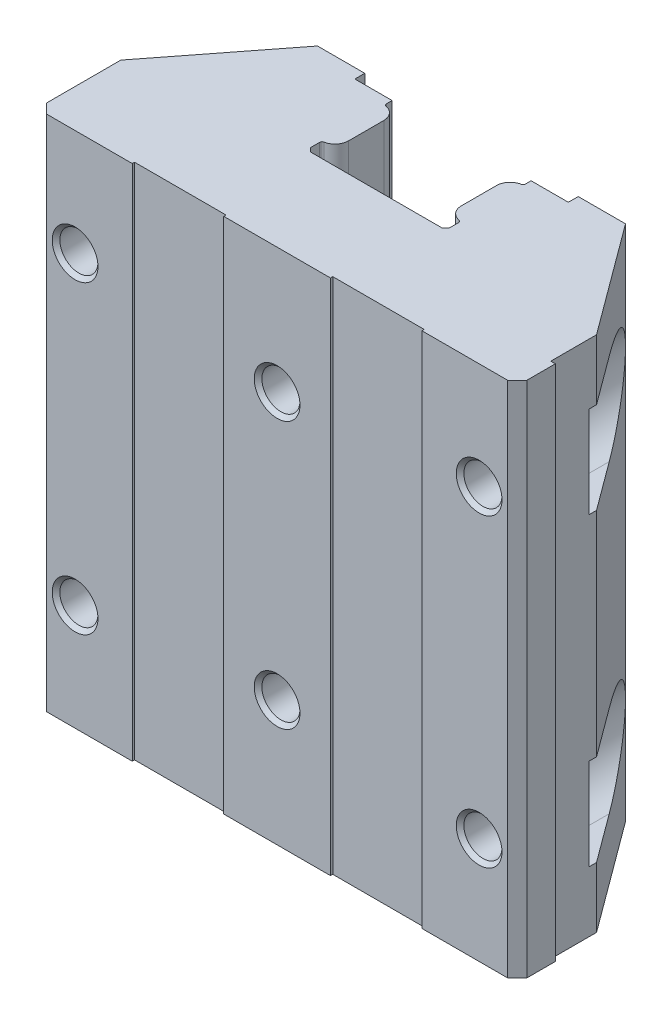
ISO-10303-21;
HEADER;
FILE_DESCRIPTION(('STEP AP214'),'2;1');
FILE_NAME('part.step','',(''),(''),'','','');
FILE_SCHEMA(('AUTOMOTIVE_DESIGN { 1 0 10303 214 1 1 1 1 }'));
ENDSEC;
DATA;
#1=APPLICATION_CONTEXT('core data for automotive mechanical design processes');
#2=APPLICATION_PROTOCOL_DEFINITION('international standard','automotive_design',2000,#1);
#3=PRODUCT_CONTEXT('',#1,'mechanical');
#4=PRODUCT('Part','Part','',(#3));
#5=PRODUCT_RELATED_PRODUCT_CATEGORY('part','',(#4));
#6=PRODUCT_DEFINITION_FORMATION('','',#4);
#7=PRODUCT_DEFINITION_CONTEXT('part definition',#1,'design');
#8=PRODUCT_DEFINITION('design','',#6,#7);
#9=PRODUCT_DEFINITION_SHAPE('','',#8);
#10=(LENGTH_UNIT() NAMED_UNIT(*) SI_UNIT(.MILLI.,.METRE.));
#11=(NAMED_UNIT(*) PLANE_ANGLE_UNIT() SI_UNIT($,.RADIAN.));
#12=(NAMED_UNIT(*) SI_UNIT($,.STERADIAN.) SOLID_ANGLE_UNIT());
#13=UNCERTAINTY_MEASURE_WITH_UNIT(LENGTH_MEASURE(1.E-05),#10,'distance_accuracy_value','');
#14=(GEOMETRIC_REPRESENTATION_CONTEXT(3) GLOBAL_UNCERTAINTY_ASSIGNED_CONTEXT((#13)) GLOBAL_UNIT_ASSIGNED_CONTEXT((#10,
#11,#12)) REPRESENTATION_CONTEXT('',''));
#15=CARTESIAN_POINT('',(0.,0.,0.));
#16=DIRECTION('',(0.,0.,1.));
#17=DIRECTION('',(1.,0.,0.));
#18=AXIS2_PLACEMENT_3D('',#15,#16,#17);
#19=CARTESIAN_POINT('',(0.,111.95,23.));
#20=DIRECTION('',(0.,0.,-1.));
#21=DIRECTION('',(-1.,0.,0.));
#22=AXIS2_PLACEMENT_3D('',#19,#20,#21);
#23=CONICAL_SURFACE('',#22,2.5,0.785398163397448);
#24=CARTESIAN_POINT('',(0.,111.95,22.5));
#25=DIRECTION('',(0.,0.,-1.));
#26=DIRECTION('',(-1.,0.,0.));
#27=AXIS2_PLACEMENT_3D('',#24,#25,#26);
#28=CIRCLE('',#27,3.00000000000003);
#29=CARTESIAN_POINT('',(-3.00000000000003,111.95,22.5));
#30=VERTEX_POINT('',#29);
#31=EDGE_CURVE('E21',#30,#30,#28,.T.);
#32=ORIENTED_EDGE('',*,*,#31,.T.);
#33=EDGE_LOOP('',(#32));
#34=FACE_BOUND('',#33,.T.);
#35=CARTESIAN_POINT('',(0.,111.95,23.));
#36=DIRECTION('',(0.,0.,-1.));
#37=DIRECTION('',(-1.,0.,0.));
#38=AXIS2_PLACEMENT_3D('',#35,#36,#37);
#39=CIRCLE('',#38,2.5);
#40=CARTESIAN_POINT('',(-2.5,111.95,23.));
#41=VERTEX_POINT('',#40);
#42=EDGE_CURVE('E535',#41,#41,#39,.T.);
#43=ORIENTED_EDGE('',*,*,#42,.F.);
#44=EDGE_LOOP('',(#43));
#45=FACE_BOUND('',#44,.T.);
#46=ADVANCED_FACE('F17',(#34,#45),#23,.F.);
#47=CARTESIAN_POINT('',(0.,146.95,23.));
#48=DIRECTION('',(0.,0.,-1.));
#49=DIRECTION('',(-1.,0.,0.));
#50=AXIS2_PLACEMENT_3D('',#47,#48,#49);
#51=CONICAL_SURFACE('',#50,2.5,0.785398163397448);
#52=CARTESIAN_POINT('',(0.,146.95,22.5));
#53=DIRECTION('',(0.,0.,-1.));
#54=DIRECTION('',(-1.,0.,0.));
#55=AXIS2_PLACEMENT_3D('',#52,#53,#54);
#56=CIRCLE('',#55,3.00000000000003);
#57=CARTESIAN_POINT('',(-3.00000000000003,146.95,22.5));
#58=VERTEX_POINT('',#57);
#59=EDGE_CURVE('E486',#58,#58,#56,.T.);
#60=ORIENTED_EDGE('',*,*,#59,.T.);
#61=EDGE_LOOP('',(#60));
#62=FACE_BOUND('',#61,.T.);
#63=CARTESIAN_POINT('',(0.,146.95,23.));
#64=DIRECTION('',(0.,0.,-1.));
#65=DIRECTION('',(-1.,0.,0.));
#66=AXIS2_PLACEMENT_3D('',#63,#64,#65);
#67=CIRCLE('',#66,2.5);
#68=CARTESIAN_POINT('',(-2.5,146.95,23.));
#69=VERTEX_POINT('',#68);
#70=EDGE_CURVE('E531',#69,#69,#67,.T.);
#71=ORIENTED_EDGE('',*,*,#70,.F.);
#72=EDGE_LOOP('',(#71));
#73=FACE_BOUND('',#72,.T.);
#74=ADVANCED_FACE('F1270',(#62,#73),#51,.F.);
#75=CARTESIAN_POINT('',(-9.11625,95.5,15.291492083));
#76=DIRECTION('',(-1.,0.,0.));
#77=DIRECTION('',(0.,0.,1.));
#78=AXIS2_PLACEMENT_3D('',#75,#76,#77);
#79=PLANE('',#78);
#80=DIRECTION('',(0.,0.,1.));
#81=VECTOR('',#80,1.);
#82=CARTESIAN_POINT('',(-9.11625,95.5,15.9001210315));
#83=LINE('',#82,#81);
#84=CARTESIAN_POINT('',(-9.11625,95.5,15.2914920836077));
#85=VERTEX_POINT('',#84);
#86=CARTESIAN_POINT('',(-9.11625,95.5,16.5087499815));
#87=VERTEX_POINT('',#86);
#88=EDGE_CURVE('E495',#85,#87,#83,.T.);
#89=ORIENTED_EDGE('',*,*,#88,.F.);
#90=DIRECTION('',(0.,1.,0.));
#91=VECTOR('',#90,1.);
#92=CARTESIAN_POINT('',(-9.11625,129.45,15.2914920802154));
#93=LINE('',#92,#91);
#94=CARTESIAN_POINT('',(-9.11625,163.4,15.2914920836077));
#95=VERTEX_POINT('',#94);
#96=EDGE_CURVE('E485',#95,#85,#93,.F.);
#97=ORIENTED_EDGE('',*,*,#96,.F.);
#98=DIRECTION('',(0.,0.,-1.));
#99=VECTOR('',#98,1.);
#100=CARTESIAN_POINT('',(-9.11625,163.4,15.9001210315));
#101=LINE('',#100,#99);
#102=CARTESIAN_POINT('',(-9.11625,163.4,16.5087499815));
#103=VERTEX_POINT('',#102);
#104=EDGE_CURVE('E498',#103,#95,#101,.T.);
#105=ORIENTED_EDGE('',*,*,#104,.F.);
#106=DIRECTION('',(0.,-1.,0.));
#107=VECTOR('',#106,1.);
#108=CARTESIAN_POINT('',(-9.11625,129.45,16.50874998));
#109=LINE('',#108,#107);
#110=EDGE_CURVE('E561',#103,#87,#109,.T.);
#111=ORIENTED_EDGE('',*,*,#110,.T.);
#112=EDGE_LOOP('',(#89,#97,#105,#111));
#113=FACE_BOUND('',#112,.T.);
#114=ADVANCED_FACE('F1266',(#113),#79,.F.);
#115=CARTESIAN_POINT('',(-6.072,118.022,22.5));
#116=DIRECTION('',(0.,0.,1.));
#117=DIRECTION('',(0.,-1.,0.));
#118=AXIS2_PLACEMENT_3D('',#115,#116,#117);
#119=PLANE('',#118);
#120=ORIENTED_EDGE('',*,*,#31,.F.);
#121=EDGE_LOOP('',(#120));
#122=FACE_BOUND('',#121,.T.);
#123=CARTESIAN_POINT('',(0.,111.95,22.5));
#124=DIRECTION('',(0.,0.,1.));
#125=DIRECTION('',(1.,0.,0.));
#126=AXIS2_PLACEMENT_3D('',#123,#124,#125);
#127=CIRCLE('',#126,6.00000000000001);
#128=CARTESIAN_POINT('',(6.00000000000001,111.95,22.5));
#129=VERTEX_POINT('',#128);
#130=EDGE_CURVE('E475',#129,#129,#127,.T.);
#131=ORIENTED_EDGE('',*,*,#130,.F.);
#132=EDGE_LOOP('',(#131));
#133=FACE_BOUND('',#132,.T.);
#134=ADVANCED_FACE('F1269',(#122,#133),#119,.F.);
#135=CARTESIAN_POINT('',(-6.072,153.022,22.5));
#136=DIRECTION('',(0.,0.,1.));
#137=DIRECTION('',(0.,-1.,0.));
#138=AXIS2_PLACEMENT_3D('',#135,#136,#137);
#139=PLANE('',#138);
#140=ORIENTED_EDGE('',*,*,#59,.F.);
#141=EDGE_LOOP('',(#140));
#142=FACE_BOUND('',#141,.T.);
#143=CARTESIAN_POINT('',(0.,146.95,22.5));
#144=DIRECTION('',(0.,0.,1.));
#145=DIRECTION('',(1.,0.,0.));
#146=AXIS2_PLACEMENT_3D('',#143,#144,#145);
#147=CIRCLE('',#146,6.00000000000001);
#148=CARTESIAN_POINT('',(6.00000000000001,146.95,22.5));
#149=VERTEX_POINT('',#148);
#150=EDGE_CURVE('E472',#149,#149,#147,.T.);
#151=ORIENTED_EDGE('',*,*,#150,.F.);
#152=EDGE_LOOP('',(#151));
#153=FACE_BOUND('',#152,.T.);
#154=ADVANCED_FACE('F1273',(#142,#153),#139,.F.);
#155=CARTESIAN_POINT('',(9.11625,95.5,16.50874998));
#156=DIRECTION('',(1.,0.,0.));
#157=DIRECTION('',(0.,0.,-1.));
#158=AXIS2_PLACEMENT_3D('',#155,#156,#157);
#159=PLANE('',#158);
#160=DIRECTION('',(0.,0.,-1.));
#161=VECTOR('',#160,1.);
#162=CARTESIAN_POINT('',(9.11625,95.5,15.9001210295));
#163=LINE('',#162,#161);
#164=CARTESIAN_POINT('',(9.11625,95.5,16.50874998));
#165=VERTEX_POINT('',#164);
#166=CARTESIAN_POINT('',(9.1162499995,95.5,15.2914920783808));
#167=VERTEX_POINT('',#166);
#168=EDGE_CURVE('E492',#165,#167,#163,.T.);
#169=ORIENTED_EDGE('',*,*,#168,.F.);
#170=DIRECTION('',(0.,1.,0.));
#171=VECTOR('',#170,1.);
#172=CARTESIAN_POINT('',(9.11625,129.45,16.50874998));
#173=LINE('',#172,#171);
#174=CARTESIAN_POINT('',(9.11625,163.4,16.50874998));
#175=VERTEX_POINT('',#174);
#176=EDGE_CURVE('E478',#165,#175,#173,.T.);
#177=ORIENTED_EDGE('',*,*,#176,.T.);
#178=DIRECTION('',(0.,0.,1.));
#179=VECTOR('',#178,1.);
#180=CARTESIAN_POINT('',(9.11625,163.4,15.9001210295));
#181=LINE('',#180,#179);
#182=CARTESIAN_POINT('',(9.1162499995,163.4,15.2914920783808));
#183=VERTEX_POINT('',#182);
#184=EDGE_CURVE('E488',#183,#175,#181,.T.);
#185=ORIENTED_EDGE('',*,*,#184,.F.);
#186=DIRECTION('',(0.,-1.,0.));
#187=VECTOR('',#186,1.);
#188=CARTESIAN_POINT('',(9.116249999,129.45,15.2914920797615));
#189=LINE('',#188,#187);
#190=EDGE_CURVE('E469',#167,#183,#189,.F.);
#191=ORIENTED_EDGE('',*,*,#190,.F.);
#192=EDGE_LOOP('',(#169,#177,#185,#191));
#193=FACE_BOUND('',#192,.T.);
#194=ADVANCED_FACE('F995',(#193),#159,.F.);
#195=CARTESIAN_POINT('',(26.2,143.45,12.586626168));
#196=DIRECTION('',(0.,-1.,0.));
#197=DIRECTION('',(1.,0.,0.));
#198=AXIS2_PLACEMENT_3D('',#195,#196,#197);
#199=PLANE('',#198);
#200=DIRECTION('',(1.,0.,0.));
#201=VECTOR('',#200,1.);
#202=CARTESIAN_POINT('',(25.5179,143.45,20.));
#203=LINE('',#202,#201);
#204=CARTESIAN_POINT('',(26.2,143.45,20.));
#205=VERTEX_POINT('',#204);
#206=CARTESIAN_POINT('',(30.9,143.45,20.0000000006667));
#207=VERTEX_POINT('',#206);
#208=EDGE_CURVE('E451',#205,#207,#203,.T.);
#209=ORIENTED_EDGE('',*,*,#208,.T.);
#210=DIRECTION('',(0.,0.,1.));
#211=VECTOR('',#210,1.);
#212=CARTESIAN_POINT('',(30.9,143.45,16.293313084));
#213=LINE('',#212,#211);
#214=CARTESIAN_POINT('',(30.9,143.449999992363,19.0000000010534));
#215=VERTEX_POINT('',#214);
#216=EDGE_CURVE('E802',#215,#207,#213,.T.);
#217=ORIENTED_EDGE('',*,*,#216,.F.);
#218=DIRECTION('',(0.593766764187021,0.,0.804637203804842));
#219=VECTOR('',#218,1.);
#220=CARTESIAN_POINT('',(25.55,143.44999998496,11.75));
#221=LINE('',#220,#219);
#222=CARTESIAN_POINT('',(26.2,143.44999999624,12.6308411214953));
#223=VERTEX_POINT('',#222);
#224=EDGE_CURVE('E458',#223,#215,#221,.T.);
#225=ORIENTED_EDGE('',*,*,#224,.F.);
#226=DIRECTION('',(0.,0.,-1.));
#227=VECTOR('',#226,1.);
#228=CARTESIAN_POINT('',(26.2,143.45,16.293313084));
#229=LINE('',#228,#227);
#230=EDGE_CURVE('E797',#205,#223,#229,.T.);
#231=ORIENTED_EDGE('',*,*,#230,.F.);
#232=EDGE_LOOP('',(#209,#217,#225,#231));
#233=FACE_BOUND('',#232,.T.);
#234=ADVANCED_FACE('F1247',(#233),#199,.F.);
#235=CARTESIAN_POINT('',(26.5,149.45,20.5));
#236=DIRECTION('',(0.,0.,-1.));
#237=DIRECTION('',(-1.,0.,0.));
#238=AXIS2_PLACEMENT_3D('',#235,#236,#237);
#239=CONICAL_SURFACE('',#238,2.5,0.785398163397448);
#240=CARTESIAN_POINT('',(26.5,149.45,20.5));
#241=DIRECTION('',(0.,0.,-1.));
#242=DIRECTION('',(-1.,0.,0.));
#243=AXIS2_PLACEMENT_3D('',#240,#241,#242);
#244=CIRCLE('',#243,2.5);
#245=CARTESIAN_POINT('',(24.,149.45,20.5));
#246=VERTEX_POINT('',#245);
#247=EDGE_CURVE('E538',#246,#246,#244,.T.);
#248=ORIENTED_EDGE('',*,*,#247,.F.);
#249=EDGE_LOOP('',(#248));
#250=FACE_BOUND('',#249,.T.);
#251=CARTESIAN_POINT('',(26.5,149.45,20.));
#252=DIRECTION('',(0.,0.,-1.));
#253=DIRECTION('',(-1.,0.,0.));
#254=AXIS2_PLACEMENT_3D('',#251,#252,#253);
#255=CIRCLE('',#254,2.99999999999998);
#256=CARTESIAN_POINT('',(23.5,149.45,20.));
#257=VERTEX_POINT('',#256);
#258=EDGE_CURVE('E448',#257,#257,#255,.T.);
#259=ORIENTED_EDGE('',*,*,#258,.T.);
#260=EDGE_LOOP('',(#259));
#261=FACE_BOUND('',#260,.T.);
#262=ADVANCED_FACE('F1235',(#250,#261),#239,.F.);
#263=CARTESIAN_POINT('',(26.2,115.45,12.586626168));
#264=DIRECTION('',(0.,1.,0.));
#265=DIRECTION('',(0.,0.,1.));
#266=AXIS2_PLACEMENT_3D('',#263,#264,#265);
#267=PLANE('',#266);
#268=DIRECTION('',(-1.,0.,0.));
#269=VECTOR('',#268,1.);
#270=CARTESIAN_POINT('',(25.5179,115.45,20.));
#271=LINE('',#270,#269);
#272=CARTESIAN_POINT('',(30.9,115.450000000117,20.000000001));
#273=VERTEX_POINT('',#272);
#274=CARTESIAN_POINT('',(26.2000000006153,115.45,20.));
#275=VERTEX_POINT('',#274);
#276=EDGE_CURVE('E447',#273,#275,#271,.T.);
#277=ORIENTED_EDGE('',*,*,#276,.T.);
#278=DIRECTION('',(0.,0.,-1.));
#279=VECTOR('',#278,1.);
#280=CARTESIAN_POINT('',(26.2000000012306,115.45,12.2035));
#281=LINE('',#280,#279);
#282=CARTESIAN_POINT('',(26.2000000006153,115.45000000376,12.6308411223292));
#283=VERTEX_POINT('',#282);
#284=EDGE_CURVE('E544',#283,#275,#281,.F.);
#285=ORIENTED_EDGE('',*,*,#284,.F.);
#286=DIRECTION('',(-0.593766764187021,0.,-0.804637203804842));
#287=VECTOR('',#286,1.);
#288=CARTESIAN_POINT('',(25.55,115.45000001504,11.75));
#289=LINE('',#288,#287);
#290=CARTESIAN_POINT('',(30.9,115.450000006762,19.0000000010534));
#291=VERTEX_POINT('',#290);
#292=EDGE_CURVE('E1204',#291,#283,#289,.T.);
#293=ORIENTED_EDGE('',*,*,#292,.F.);
#294=DIRECTION('',(0.,0.,-1.));
#295=VECTOR('',#294,1.);
#296=CARTESIAN_POINT('',(30.9,115.45,16.293313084));
#297=LINE('',#296,#295);
#298=EDGE_CURVE('E795',#273,#291,#297,.T.);
#299=ORIENTED_EDGE('',*,*,#298,.F.);
#300=EDGE_LOOP('',(#277,#285,#293,#299));
#301=FACE_BOUND('',#300,.T.);
#302=ADVANCED_FACE('F1232',(#301),#267,.F.);
#303=CARTESIAN_POINT('',(26.5,109.45,20.5));
#304=DIRECTION('',(0.,0.,-1.));
#305=DIRECTION('',(-1.,0.,0.));
#306=AXIS2_PLACEMENT_3D('',#303,#304,#305);
#307=CONICAL_SURFACE('',#306,2.5,0.785398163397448);
#308=CARTESIAN_POINT('',(26.5,109.45,20.5));
#309=DIRECTION('',(0.,0.,-1.));
#310=DIRECTION('',(-1.,0.,0.));
#311=AXIS2_PLACEMENT_3D('',#308,#309,#310);
#312=CIRCLE('',#311,2.5);
#313=CARTESIAN_POINT('',(24.,109.45,20.5));
#314=VERTEX_POINT('',#313);
#315=EDGE_CURVE('E541',#314,#314,#312,.T.);
#316=ORIENTED_EDGE('',*,*,#315,.F.);
#317=EDGE_LOOP('',(#316));
#318=FACE_BOUND('',#317,.T.);
#319=CARTESIAN_POINT('',(26.5,109.45,20.));
#320=DIRECTION('',(0.,0.,-1.));
#321=DIRECTION('',(-1.,0.,0.));
#322=AXIS2_PLACEMENT_3D('',#319,#320,#321);
#323=CIRCLE('',#322,2.99999999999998);
#324=CARTESIAN_POINT('',(23.5,109.45,20.));
#325=VERTEX_POINT('',#324);
#326=EDGE_CURVE('E439',#325,#325,#323,.T.);
#327=ORIENTED_EDGE('',*,*,#326,.T.);
#328=EDGE_LOOP('',(#327));
#329=FACE_BOUND('',#328,.T.);
#330=ADVANCED_FACE('F1234',(#318,#329),#307,.F.);
#331=CARTESIAN_POINT('',(26.5,109.45,29.5));
#332=DIRECTION('',(0.,0.,-1.));
#333=DIRECTION('',(0.,1.,0.));
#334=AXIS2_PLACEMENT_3D('',#331,#332,#333);
#335=CYLINDRICAL_SURFACE('',#334,2.5);
#336=ORIENTED_EDGE('',*,*,#315,.T.);
#337=EDGE_LOOP('',(#336));
#338=FACE_BOUND('',#337,.T.);
#339=CARTESIAN_POINT('',(26.5,109.45,29.5));
#340=DIRECTION('',(0.,0.,1.));
#341=DIRECTION('',(0.,-1.,0.));
#342=AXIS2_PLACEMENT_3D('',#339,#340,#341);
#343=CIRCLE('',#342,2.5);
#344=CARTESIAN_POINT('',(26.5,106.95,29.5));
#345=VERTEX_POINT('',#344);
#346=EDGE_CURVE('E785',#345,#345,#343,.F.);
#347=ORIENTED_EDGE('',*,*,#346,.F.);
#348=EDGE_LOOP('',(#347));
#349=FACE_BOUND('',#348,.T.);
#350=ADVANCED_FACE('F1243',(#338,#349),#335,.F.);
#351=CARTESIAN_POINT('',(26.5,149.45,29.5));
#352=DIRECTION('',(0.,0.,-1.));
#353=DIRECTION('',(0.,1.,0.));
#354=AXIS2_PLACEMENT_3D('',#351,#352,#353);
#355=CYLINDRICAL_SURFACE('',#354,2.5);
#356=ORIENTED_EDGE('',*,*,#247,.T.);
#357=EDGE_LOOP('',(#356));
#358=FACE_BOUND('',#357,.T.);
#359=CARTESIAN_POINT('',(26.5,149.45,29.5));
#360=DIRECTION('',(0.,0.,1.));
#361=DIRECTION('',(0.,-1.,0.));
#362=AXIS2_PLACEMENT_3D('',#359,#360,#361);
#363=CIRCLE('',#362,2.5);
#364=CARTESIAN_POINT('',(26.5,146.95,29.5));
#365=VERTEX_POINT('',#364);
#366=EDGE_CURVE('E781',#365,#365,#363,.F.);
#367=ORIENTED_EDGE('',*,*,#366,.F.);
#368=EDGE_LOOP('',(#367));
#369=FACE_BOUND('',#368,.T.);
#370=ADVANCED_FACE('F1514',(#358,#369),#355,.F.);
#371=CARTESIAN_POINT('',(0.,111.95,29.5));
#372=DIRECTION('',(0.,0.,-1.));
#373=DIRECTION('',(0.,1.,0.));
#374=AXIS2_PLACEMENT_3D('',#371,#372,#373);
#375=CYLINDRICAL_SURFACE('',#374,2.5);
#376=ORIENTED_EDGE('',*,*,#42,.T.);
#377=EDGE_LOOP('',(#376));
#378=FACE_BOUND('',#377,.T.);
#379=CARTESIAN_POINT('',(0.,111.95,29.5));
#380=DIRECTION('',(0.,0.,1.));
#381=DIRECTION('',(0.,-1.,0.));
#382=AXIS2_PLACEMENT_3D('',#379,#380,#381);
#383=CIRCLE('',#382,2.5);
#384=CARTESIAN_POINT('',(0.,109.45,29.5));
#385=VERTEX_POINT('',#384);
#386=EDGE_CURVE('E777',#385,#385,#383,.F.);
#387=ORIENTED_EDGE('',*,*,#386,.F.);
#388=EDGE_LOOP('',(#387));
#389=FACE_BOUND('',#388,.T.);
#390=ADVANCED_FACE('F1402',(#378,#389),#375,.F.);
#391=CARTESIAN_POINT('',(0.,146.95,29.5));
#392=DIRECTION('',(0.,0.,-1.));
#393=DIRECTION('',(0.,1.,0.));
#394=AXIS2_PLACEMENT_3D('',#391,#392,#393);
#395=CYLINDRICAL_SURFACE('',#394,2.5);
#396=ORIENTED_EDGE('',*,*,#70,.T.);
#397=EDGE_LOOP('',(#396));
#398=FACE_BOUND('',#397,.T.);
#399=CARTESIAN_POINT('',(0.,146.95,29.5));
#400=DIRECTION('',(0.,0.,1.));
#401=DIRECTION('',(0.,-1.,0.));
#402=AXIS2_PLACEMENT_3D('',#399,#400,#401);
#403=CIRCLE('',#402,2.5);
#404=CARTESIAN_POINT('',(0.,144.45,29.5));
#405=VERTEX_POINT('',#404);
#406=EDGE_CURVE('E774',#405,#405,#403,.F.);
#407=ORIENTED_EDGE('',*,*,#406,.F.);
#408=EDGE_LOOP('',(#407));
#409=FACE_BOUND('',#408,.T.);
#410=ADVANCED_FACE('F1312',(#398,#409),#395,.F.);
#411=CARTESIAN_POINT('',(-31.5,143.45,20.));
#412=DIRECTION('',(0.,-1.,0.));
#413=DIRECTION('',(0.,0.,-1.));
#414=AXIS2_PLACEMENT_3D('',#411,#412,#413);
#415=PLANE('',#414);
#416=DIRECTION('',(1.,0.,0.));
#417=VECTOR('',#416,1.);
#418=CARTESIAN_POINT('',(-25.8161,143.45,20.));
#419=LINE('',#418,#417);
#420=CARTESIAN_POINT('',(-31.5,143.449999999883,20.0000000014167));
#421=VERTEX_POINT('',#420);
#422=CARTESIAN_POINT('',(-26.1999999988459,143.45,20.));
#423=VERTEX_POINT('',#422);
#424=EDGE_CURVE('E438',#421,#423,#419,.T.);
#425=ORIENTED_EDGE('',*,*,#424,.T.);
#426=DIRECTION('',(0.,0.,-1.));
#427=VECTOR('',#426,1.);
#428=CARTESIAN_POINT('',(-26.1999999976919,143.45,12.2035));
#429=LINE('',#428,#427);
#430=CARTESIAN_POINT('',(-26.1999999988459,143.44999999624,12.1991150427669));
#431=VERTEX_POINT('',#430);
#432=EDGE_CURVE('E747',#431,#423,#429,.F.);
#433=ORIENTED_EDGE('',*,*,#432,.F.);
#434=DIRECTION('',(0.614693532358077,0.,-0.788766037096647));
#435=VECTOR('',#434,1.);
#436=CARTESIAN_POINT('',(-25.85,143.44999998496,11.75));
#437=LINE('',#436,#435);
#438=CARTESIAN_POINT('',(-31.5,143.449999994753,19.0000000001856));
#439=VERTEX_POINT('',#438);
#440=EDGE_CURVE('E433',#439,#431,#437,.T.);
#441=ORIENTED_EDGE('',*,*,#440,.F.);
#442=DIRECTION('',(0.,0.,-1.));
#443=VECTOR('',#442,1.);
#444=CARTESIAN_POINT('',(-31.5,143.45,16.0761548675));
#445=LINE('',#444,#443);
#446=EDGE_CURVE('E534',#421,#439,#445,.T.);
#447=ORIENTED_EDGE('',*,*,#446,.F.);
#448=EDGE_LOOP('',(#425,#433,#441,#447));
#449=FACE_BOUND('',#448,.T.);
#450=ADVANCED_FACE('F1309',(#449),#415,.F.);
#451=CARTESIAN_POINT('',(26.2,155.45,12.586626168));
#452=DIRECTION('',(0.,1.,0.));
#453=DIRECTION('',(0.,0.,1.));
#454=AXIS2_PLACEMENT_3D('',#451,#452,#453);
#455=PLANE('',#454);
#456=DIRECTION('',(-1.,0.,0.));
#457=VECTOR('',#456,1.);
#458=CARTESIAN_POINT('',(25.5179,155.45,20.));
#459=LINE('',#458,#457);
#460=CARTESIAN_POINT('',(30.9,155.449999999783,20.0000000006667));
#461=VERTEX_POINT('',#460);
#462=CARTESIAN_POINT('',(26.2000000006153,155.45,20.));
#463=VERTEX_POINT('',#462);
#464=EDGE_CURVE('E455',#461,#463,#459,.T.);
#465=ORIENTED_EDGE('',*,*,#464,.T.);
#466=DIRECTION('',(0.,0.,-1.));
#467=VECTOR('',#466,1.);
#468=CARTESIAN_POINT('',(26.2000000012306,155.45,12.2035));
#469=LINE('',#468,#467);
#470=CARTESIAN_POINT('',(26.2000000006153,155.450000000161,12.6308411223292));
#471=VERTEX_POINT('',#470);
#472=EDGE_CURVE('E754',#471,#463,#469,.F.);
#473=ORIENTED_EDGE('',*,*,#472,.F.);
#474=DIRECTION('',(-0.593766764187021,0.,-0.804637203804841));
#475=VECTOR('',#474,1.);
#476=CARTESIAN_POINT('',(25.55,155.450000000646,11.75));
#477=LINE('',#476,#475);
#478=CARTESIAN_POINT('',(30.9,155.45000000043,19.));
#479=VERTEX_POINT('',#478);
#480=EDGE_CURVE('E418',#479,#471,#477,.T.);
#481=ORIENTED_EDGE('',*,*,#480,.F.);
#482=DIRECTION('',(0.,0.,-1.));
#483=VECTOR('',#482,1.);
#484=CARTESIAN_POINT('',(30.9,155.45,16.293313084));
#485=LINE('',#484,#483);
#486=EDGE_CURVE('E757',#461,#479,#485,.T.);
#487=ORIENTED_EDGE('',*,*,#486,.F.);
#488=EDGE_LOOP('',(#465,#473,#481,#487));
#489=FACE_BOUND('',#488,.T.);
#490=ADVANCED_FACE('F1295',(#489),#455,.F.);
#491=CARTESIAN_POINT('',(26.2,149.45,20.));
#492=DIRECTION('',(0.,0.,-1.));
#493=DIRECTION('',(0.,1.,0.));
#494=AXIS2_PLACEMENT_3D('',#491,#492,#493);
#495=CYLINDRICAL_SURFACE('',#494,6.);
#496=CARTESIAN_POINT('',(26.2,149.45,12.6308411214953));
#497=DIRECTION('',(0.804637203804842,0.,-0.593766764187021));
#498=DIRECTION('',(-0.593766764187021,0.,-0.804637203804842));
#499=AXIS2_PLACEMENT_3D('',#496,#497,#498);
#500=ELLIPSE('',#499,10.1049778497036,6.);
#501=CARTESIAN_POINT('',(20.2,149.449999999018,4.5));
#502=VERTEX_POINT('',#501);
#503=EDGE_CURVE('E416',#471,#502,#500,.F.);
#504=ORIENTED_EDGE('',*,*,#503,.F.);
#505=ORIENTED_EDGE('',*,*,#472,.T.);
#506=CARTESIAN_POINT('',(26.2,149.45,20.));
#507=DIRECTION('',(0.,0.,-1.));
#508=DIRECTION('',(0.,1.,0.));
#509=AXIS2_PLACEMENT_3D('',#506,#507,#508);
#510=CIRCLE('',#509,6.);
#511=EDGE_CURVE('E452',#463,#205,#510,.F.);
#512=ORIENTED_EDGE('',*,*,#511,.T.);
#513=ORIENTED_EDGE('',*,*,#230,.T.);
#514=CARTESIAN_POINT('',(26.2,149.45,12.6308411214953));
#515=DIRECTION('',(0.804637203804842,0.,-0.593766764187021));
#516=DIRECTION('',(-0.593766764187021,0.,-0.804637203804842));
#517=AXIS2_PLACEMENT_3D('',#514,#515,#516);
#518=ELLIPSE('',#517,10.1049778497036,6.);
#519=EDGE_CURVE('E456',#502,#223,#518,.F.);
#520=ORIENTED_EDGE('',*,*,#519,.F.);
#521=EDGE_LOOP('',(#504,#505,#512,#513,#520));
#522=FACE_BOUND('',#521,.T.);
#523=ADVANCED_FACE('F1301',(#522),#495,.F.);
#524=CARTESIAN_POINT('',(-26.2,149.45,20.));
#525=DIRECTION('',(0.,0.,-1.));
#526=DIRECTION('',(0.,1.,0.));
#527=AXIS2_PLACEMENT_3D('',#524,#525,#526);
#528=CYLINDRICAL_SURFACE('',#527,6.00000000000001);
#529=DIRECTION('',(0.,0.,-1.));
#530=VECTOR('',#529,1.);
#531=CARTESIAN_POINT('',(-26.2,155.45,16.0761548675));
#532=LINE('',#531,#530);
#533=CARTESIAN_POINT('',(-26.2,155.45,20.));
#534=VERTEX_POINT('',#533);
#535=CARTESIAN_POINT('',(-26.2,155.450000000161,12.1991150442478));
#536=VERTEX_POINT('',#535);
#537=EDGE_CURVE('E512',#534,#536,#532,.T.);
#538=ORIENTED_EDGE('',*,*,#537,.T.);
#539=CARTESIAN_POINT('',(-26.2,149.45,12.1991150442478));
#540=DIRECTION('',(-0.788766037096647,0.,-0.614693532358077));
#541=DIRECTION('',(0.614693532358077,0.,-0.788766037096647));
#542=AXIS2_PLACEMENT_3D('',#539,#540,#541);
#543=ELLIPSE('',#542,9.76096165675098,6.00000000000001);
#544=CARTESIAN_POINT('',(-20.2,149.449999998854,4.5));
#545=VERTEX_POINT('',#544);
#546=EDGE_CURVE('E413',#545,#536,#543,.F.);
#547=ORIENTED_EDGE('',*,*,#546,.F.);
#548=CARTESIAN_POINT('',(-26.2,149.45,12.1991150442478));
#549=DIRECTION('',(-0.788766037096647,0.,-0.614693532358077));
#550=DIRECTION('',(0.614693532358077,0.,-0.788766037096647));
#551=AXIS2_PLACEMENT_3D('',#548,#549,#550);
#552=ELLIPSE('',#551,9.76096165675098,6.00000000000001);
#553=EDGE_CURVE('E430',#431,#545,#552,.F.);
#554=ORIENTED_EDGE('',*,*,#553,.F.);
#555=ORIENTED_EDGE('',*,*,#432,.T.);
#556=CARTESIAN_POINT('',(-26.2,149.45,20.));
#557=DIRECTION('',(0.,0.,-1.));
#558=DIRECTION('',(0.,1.,0.));
#559=AXIS2_PLACEMENT_3D('',#556,#557,#558);
#560=CIRCLE('',#559,6.00000000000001);
#561=EDGE_CURVE('E434',#423,#534,#560,.F.);
#562=ORIENTED_EDGE('',*,*,#561,.T.);
#563=EDGE_LOOP('',(#538,#547,#554,#555,#562));
#564=FACE_BOUND('',#563,.T.);
#565=ADVANCED_FACE('F1051',(#564),#528,.F.);
#566=CARTESIAN_POINT('',(-31.5,155.45,12.152309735));
#567=DIRECTION('',(0.,1.,0.));
#568=DIRECTION('',(0.,0.,1.));
#569=AXIS2_PLACEMENT_3D('',#566,#567,#568);
#570=PLANE('',#569);
#571=DIRECTION('',(-1.,0.,0.));
#572=VECTOR('',#571,1.);
#573=CARTESIAN_POINT('',(-25.8161,155.45,20.));
#574=LINE('',#573,#572);
#575=CARTESIAN_POINT('',(-31.5,155.449999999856,20.0000000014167));
#576=VERTEX_POINT('',#575);
#577=EDGE_CURVE('E437',#534,#576,#574,.T.);
#578=ORIENTED_EDGE('',*,*,#577,.T.);
#579=DIRECTION('',(0.,0.,1.));
#580=VECTOR('',#579,1.);
#581=CARTESIAN_POINT('',(-31.5,155.45,16.0761548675));
#582=LINE('',#581,#580);
#583=CARTESIAN_POINT('',(-31.5,155.45000000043,19.));
#584=VERTEX_POINT('',#583);
#585=EDGE_CURVE('E745',#584,#576,#582,.T.);
#586=ORIENTED_EDGE('',*,*,#585,.F.);
#587=DIRECTION('',(-0.614693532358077,0.,0.788766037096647));
#588=VECTOR('',#587,1.);
#589=CARTESIAN_POINT('',(-25.85,155.450000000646,11.75));
#590=LINE('',#589,#588);
#591=EDGE_CURVE('E415',#536,#584,#590,.T.);
#592=ORIENTED_EDGE('',*,*,#591,.F.);
#593=ORIENTED_EDGE('',*,*,#537,.F.);
#594=EDGE_LOOP('',(#578,#586,#592,#593));
#595=FACE_BOUND('',#594,.T.);
#596=ADVANCED_FACE('F1061',(#595),#570,.F.);
#597=CARTESIAN_POINT('',(-9.11625,95.5,5.8));
#598=DIRECTION('',(-1.,0.,0.));
#599=DIRECTION('',(0.,0.,1.));
#600=AXIS2_PLACEMENT_3D('',#597,#598,#599);
#601=PLANE('',#600);
#602=DIRECTION('',(0.,0.,1.));
#603=VECTOR('',#602,1.);
#604=CARTESIAN_POINT('',(-9.11625,95.5,6.1742539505));
#605=LINE('',#604,#603);
#606=CARTESIAN_POINT('',(-9.11625,95.5,5.799999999));
#607=VERTEX_POINT('',#606);
#608=CARTESIAN_POINT('',(-9.11625,95.5,6.5485079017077));
#609=VERTEX_POINT('',#608);
#610=EDGE_CURVE('E316',#607,#609,#605,.T.);
#611=ORIENTED_EDGE('',*,*,#610,.F.);
#612=DIRECTION('',(0.,-1.,0.));
#613=VECTOR('',#612,1.);
#614=CARTESIAN_POINT('',(-9.11625,129.45,5.8));
#615=LINE('',#614,#613);
#616=CARTESIAN_POINT('',(-9.11625,163.4,5.7999999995));
#617=VERTEX_POINT('',#616);
#618=EDGE_CURVE('E331',#617,#607,#615,.T.);
#619=ORIENTED_EDGE('',*,*,#618,.F.);
#620=DIRECTION('',(0.,0.,-1.));
#621=VECTOR('',#620,1.);
#622=CARTESIAN_POINT('',(-9.11625,163.4,6.1742539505));
#623=LINE('',#622,#621);
#624=CARTESIAN_POINT('',(-9.11625,163.4,6.5485079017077));
#625=VERTEX_POINT('',#624);
#626=EDGE_CURVE('E510',#625,#617,#623,.T.);
#627=ORIENTED_EDGE('',*,*,#626,.F.);
#628=DIRECTION('',(0.,-1.,0.));
#629=VECTOR('',#628,1.);
#630=CARTESIAN_POINT('',(-9.11625,129.45,6.54850790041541));
#631=LINE('',#630,#629);
#632=EDGE_CURVE('E320',#609,#625,#631,.F.);
#633=ORIENTED_EDGE('',*,*,#632,.F.);
#634=EDGE_LOOP('',(#611,#619,#627,#633));
#635=FACE_BOUND('',#634,.T.);
#636=ADVANCED_FACE('F1317',(#635),#601,.F.);
#637=CARTESIAN_POINT('',(-8.816250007,163.4,6.548507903));
#638=DIRECTION('',(0.,-1.,0.));
#639=DIRECTION('',(0.,0.,-1.));
#640=AXIS2_PLACEMENT_3D('',#637,#638,#639);
#641=CYLINDRICAL_SURFACE('',#640,0.299999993);
#642=ORIENTED_EDGE('',*,*,#632,.T.);
#643=CARTESIAN_POINT('',(-8.816250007,163.4,6.548507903));
#644=DIRECTION('',(0.,-1.,0.));
#645=DIRECTION('',(0.,0.,-1.));
#646=AXIS2_PLACEMENT_3D('',#643,#644,#645);
#647=CIRCLE('',#646,0.299999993);
#648=CARTESIAN_POINT('',(-8.8701363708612,163.4,6.84362865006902));
#649=VERTEX_POINT('',#648);
#650=EDGE_CURVE('E326',#625,#649,#647,.F.);
#651=ORIENTED_EDGE('',*,*,#650,.T.);
#652=DIRECTION('',(0.,1.,0.));
#653=VECTOR('',#652,1.);
#654=CARTESIAN_POINT('',(-8.87013636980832,129.45,6.84362864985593));
#655=LINE('',#654,#653);
#656=CARTESIAN_POINT('',(-8.8701363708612,95.5,6.84362865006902));
#657=VERTEX_POINT('',#656);
#658=EDGE_CURVE('E323',#649,#657,#655,.F.);
#659=ORIENTED_EDGE('',*,*,#658,.T.);
#660=CARTESIAN_POINT('',(-8.816250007,95.5,6.548507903));
#661=DIRECTION('',(0.,-1.,0.));
#662=DIRECTION('',(0.,0.,-1.));
#663=AXIS2_PLACEMENT_3D('',#660,#661,#662);
#664=CIRCLE('',#663,0.299999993);
#665=EDGE_CURVE('E309',#657,#609,#664,.T.);
#666=ORIENTED_EDGE('',*,*,#665,.T.);
#667=EDGE_LOOP('',(#642,#651,#659,#666));
#668=FACE_BOUND('',#667,.T.);
#669=ADVANCED_FACE('F324',(#668),#641,.F.);
#670=CARTESIAN_POINT('',(-8.816249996,163.4,15.291492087));
#671=DIRECTION('',(0.,-1.,0.));
#672=DIRECTION('',(0.,0.,-1.));
#673=AXIS2_PLACEMENT_3D('',#670,#671,#672);
#674=CYLINDRICAL_SURFACE('',#673,0.300000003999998);
#675=DIRECTION('',(0.,-1.,0.));
#676=VECTOR('',#675,1.);
#677=CARTESIAN_POINT('',(-8.87013637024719,129.45,14.9963713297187));
#678=LINE('',#677,#676);
#679=CARTESIAN_POINT('',(-8.87013636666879,95.5,14.9963713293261));
#680=VERTEX_POINT('',#679);
#681=CARTESIAN_POINT('',(-8.87013636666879,163.4,14.9963713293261));
#682=VERTEX_POINT('',#681);
#683=EDGE_CURVE('E670',#680,#682,#678,.F.);
#684=ORIENTED_EDGE('',*,*,#683,.T.);
#685=CARTESIAN_POINT('',(-8.816249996,163.4,15.291492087));
#686=DIRECTION('',(0.,-1.,0.));
#687=DIRECTION('',(0.,0.,-1.));
#688=AXIS2_PLACEMENT_3D('',#685,#686,#687);
#689=CIRCLE('',#688,0.300000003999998);
#690=EDGE_CURVE('E479',#682,#95,#689,.F.);
#691=ORIENTED_EDGE('',*,*,#690,.T.);
#692=ORIENTED_EDGE('',*,*,#96,.T.);
#693=CARTESIAN_POINT('',(-8.816249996,95.5,15.291492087));
#694=DIRECTION('',(0.,-1.,0.));
#695=DIRECTION('',(0.,0.,-1.));
#696=AXIS2_PLACEMENT_3D('',#693,#694,#695);
#697=CIRCLE('',#696,0.300000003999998);
#698=EDGE_CURVE('E483',#85,#680,#697,.T.);
#699=ORIENTED_EDGE('',*,*,#698,.T.);
#700=EDGE_LOOP('',(#684,#691,#692,#699));
#701=FACE_BOUND('',#700,.T.);
#702=ADVANCED_FACE('F850',(#701),#674,.F.);
#703=CARTESIAN_POINT('',(-9.11625,95.5,16.50874998));
#704=DIRECTION('',(-0.707106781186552,0.,0.707106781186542));
#705=DIRECTION('',(0.707106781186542,0.,0.707106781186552));
#706=AXIS2_PLACEMENT_3D('',#703,#704,#705);
#707=PLANE('',#706);
#708=DIRECTION('',(0.707106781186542,0.,0.707106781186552));
#709=VECTOR('',#708,1.);
#710=CARTESIAN_POINT('',(-8.870625,95.5,16.75437498));
#711=LINE('',#710,#709);
#712=CARTESIAN_POINT('',(-8.6250000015,95.5,16.99999998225));
#713=VERTEX_POINT('',#712);
#714=EDGE_CURVE('E557',#87,#713,#711,.T.);
#715=ORIENTED_EDGE('',*,*,#714,.F.);
#716=ORIENTED_EDGE('',*,*,#110,.F.);
#717=DIRECTION('',(-0.707106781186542,0.,-0.707106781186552));
#718=VECTOR('',#717,1.);
#719=CARTESIAN_POINT('',(-8.870625,163.4,16.75437498));
#720=LINE('',#719,#718);
#721=CARTESIAN_POINT('',(-8.6250000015,163.4,16.99999998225));
#722=VERTEX_POINT('',#721);
#723=EDGE_CURVE('E482',#722,#103,#720,.T.);
#724=ORIENTED_EDGE('',*,*,#723,.F.);
#725=DIRECTION('',(0.,-1.,0.));
#726=VECTOR('',#725,1.);
#727=CARTESIAN_POINT('',(-8.625,129.45,16.99999998));
#728=LINE('',#727,#726);
#729=EDGE_CURVE('E673',#722,#713,#728,.T.);
#730=ORIENTED_EDGE('',*,*,#729,.T.);
#731=EDGE_LOOP('',(#715,#716,#724,#730));
#732=FACE_BOUND('',#731,.T.);
#733=ADVANCED_FACE('F1320',(#732),#707,.F.);
#734=CARTESIAN_POINT('',(8.625,95.5,16.99999998));
#735=DIRECTION('',(0.707106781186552,0.,0.707106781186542));
#736=DIRECTION('',(0.707106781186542,0.,-0.707106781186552));
#737=AXIS2_PLACEMENT_3D('',#734,#735,#736);
#738=PLANE('',#737);
#739=DIRECTION('',(0.707106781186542,0.,-0.707106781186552));
#740=VECTOR('',#739,1.);
#741=CARTESIAN_POINT('',(8.870625,95.5,16.75437498));
#742=LINE('',#741,#740);
#743=CARTESIAN_POINT('',(8.6250000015,95.5,16.99999998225));
#744=VERTEX_POINT('',#743);
#745=EDGE_CURVE('E547',#744,#165,#742,.T.);
#746=ORIENTED_EDGE('',*,*,#745,.F.);
#747=DIRECTION('',(0.,1.,0.));
#748=VECTOR('',#747,1.);
#749=CARTESIAN_POINT('',(8.625,129.45,16.99999998));
#750=LINE('',#749,#748);
#751=CARTESIAN_POINT('',(8.6250000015,163.4,16.99999998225));
#752=VERTEX_POINT('',#751);
#753=EDGE_CURVE('E412',#744,#752,#750,.T.);
#754=ORIENTED_EDGE('',*,*,#753,.T.);
#755=DIRECTION('',(-0.707106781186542,0.,0.707106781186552));
#756=VECTOR('',#755,1.);
#757=CARTESIAN_POINT('',(8.870625,163.4,16.75437498));
#758=LINE('',#757,#756);
#759=EDGE_CURVE('E552',#175,#752,#758,.T.);
#760=ORIENTED_EDGE('',*,*,#759,.F.);
#761=ORIENTED_EDGE('',*,*,#176,.F.);
#762=EDGE_LOOP('',(#746,#754,#760,#761));
#763=FACE_BOUND('',#762,.T.);
#764=ADVANCED_FACE('F997',(#763),#738,.F.);
#765=CARTESIAN_POINT('',(0.,111.95,17.));
#766=DIRECTION('',(0.,0.,1.));
#767=DIRECTION('',(1.,0.,0.));
#768=AXIS2_PLACEMENT_3D('',#765,#766,#767);
#769=CYLINDRICAL_SURFACE('',#768,6.00000000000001);
#770=ORIENTED_EDGE('',*,*,#130,.T.);
#771=EDGE_LOOP('',(#770));
#772=FACE_BOUND('',#771,.T.);
#773=CARTESIAN_POINT('',(0.,111.95,17.));
#774=DIRECTION('',(0.,0.,1.));
#775=DIRECTION('',(1.,0.,0.));
#776=AXIS2_PLACEMENT_3D('',#773,#774,#775);
#777=CIRCLE('',#776,6.00000000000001);
#778=CARTESIAN_POINT('',(6.00000000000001,111.95,17.));
#779=VERTEX_POINT('',#778);
#780=EDGE_CURVE('E409',#779,#779,#777,.F.);
#781=ORIENTED_EDGE('',*,*,#780,.T.);
#782=EDGE_LOOP('',(#781));
#783=FACE_BOUND('',#782,.T.);
#784=ADVANCED_FACE('F1321',(#772,#783),#769,.F.);
#785=CARTESIAN_POINT('',(0.,146.95,17.));
#786=DIRECTION('',(0.,0.,1.));
#787=DIRECTION('',(1.,0.,0.));
#788=AXIS2_PLACEMENT_3D('',#785,#786,#787);
#789=CYLINDRICAL_SURFACE('',#788,6.00000000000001);
#790=ORIENTED_EDGE('',*,*,#150,.T.);
#791=EDGE_LOOP('',(#790));
#792=FACE_BOUND('',#791,.T.);
#793=CARTESIAN_POINT('',(0.,146.95,17.));
#794=DIRECTION('',(0.,0.,1.));
#795=DIRECTION('',(1.,0.,0.));
#796=AXIS2_PLACEMENT_3D('',#793,#794,#795);
#797=CIRCLE('',#796,6.00000000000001);
#798=CARTESIAN_POINT('',(6.00000000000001,146.95,17.));
#799=VERTEX_POINT('',#798);
#800=EDGE_CURVE('E405',#799,#799,#797,.F.);
#801=ORIENTED_EDGE('',*,*,#800,.T.);
#802=EDGE_LOOP('',(#801));
#803=FACE_BOUND('',#802,.T.);
#804=ADVANCED_FACE('F1324',(#792,#803),#789,.F.);
#805=CARTESIAN_POINT('',(8.816250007,163.4,15.291492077));
#806=DIRECTION('',(0.,-1.,0.));
#807=DIRECTION('',(0.,0.,-1.));
#808=AXIS2_PLACEMENT_3D('',#805,#806,#807);
#809=CYLINDRICAL_SURFACE('',#808,0.299999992);
#810=ORIENTED_EDGE('',*,*,#190,.T.);
#811=CARTESIAN_POINT('',(8.816250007,163.4,15.291492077));
#812=DIRECTION('',(0.,-1.,0.));
#813=DIRECTION('',(0.,0.,-1.));
#814=AXIS2_PLACEMENT_3D('',#811,#812,#813);
#815=CIRCLE('',#814,0.299999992);
#816=CARTESIAN_POINT('',(8.8701363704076,163.4,14.9963713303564));
#817=VERTEX_POINT('',#816);
#818=EDGE_CURVE('E467',#183,#817,#815,.F.);
#819=ORIENTED_EDGE('',*,*,#818,.T.);
#820=DIRECTION('',(0.,1.,0.));
#821=VECTOR('',#820,1.);
#822=CARTESIAN_POINT('',(8.87013636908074,129.45,14.9963713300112));
#823=LINE('',#822,#821);
#824=CARTESIAN_POINT('',(8.8701363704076,95.5,14.9963713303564));
#825=VERTEX_POINT('',#824);
#826=EDGE_CURVE('E408',#817,#825,#823,.F.);
#827=ORIENTED_EDGE('',*,*,#826,.T.);
#828=CARTESIAN_POINT('',(8.816250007,95.5,15.291492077));
#829=DIRECTION('',(0.,-1.,0.));
#830=DIRECTION('',(0.,0.,-1.));
#831=AXIS2_PLACEMENT_3D('',#828,#829,#830);
#832=CIRCLE('',#831,0.299999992);
#833=EDGE_CURVE('E470',#825,#167,#832,.T.);
#834=ORIENTED_EDGE('',*,*,#833,.T.);
#835=EDGE_LOOP('',(#810,#819,#827,#834));
#836=FACE_BOUND('',#835,.T.);
#837=ADVANCED_FACE('F989',(#836),#809,.F.);
#838=CARTESIAN_POINT('',(8.816249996,163.4,6.548507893));
#839=DIRECTION('',(0.,-1.,0.));
#840=DIRECTION('',(0.,0.,-1.));
#841=AXIS2_PLACEMENT_3D('',#838,#839,#840);
#842=CYLINDRICAL_SURFACE('',#841,0.300000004);
#843=DIRECTION('',(0.,-1.,0.));
#844=VECTOR('',#843,1.);
#845=CARTESIAN_POINT('',(8.87013636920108,129.45,6.84362865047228));
#846=LINE('',#845,#844);
#847=CARTESIAN_POINT('',(8.87013636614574,95.5,6.84362865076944));
#848=VERTEX_POINT('',#847);
#849=CARTESIAN_POINT('',(8.87013636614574,163.4,6.84362865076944));
#850=VERTEX_POINT('',#849);
#851=EDGE_CURVE('E659',#848,#850,#846,.F.);
#852=ORIENTED_EDGE('',*,*,#851,.T.);
#853=CARTESIAN_POINT('',(8.816249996,163.4,6.548507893));
#854=DIRECTION('',(0.,-1.,0.));
#855=DIRECTION('',(0.,0.,-1.));
#856=AXIS2_PLACEMENT_3D('',#853,#854,#855);
#857=CIRCLE('',#856,0.300000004);
#858=CARTESIAN_POINT('',(9.11625,163.4,6.548507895));
#859=VERTEX_POINT('',#858);
#860=EDGE_CURVE('E462',#850,#859,#857,.F.);
#861=ORIENTED_EDGE('',*,*,#860,.T.);
#862=DIRECTION('',(0.,-1.,0.));
#863=VECTOR('',#862,1.);
#864=CARTESIAN_POINT('',(9.11625,129.45,6.548507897));
#865=LINE('',#864,#863);
#866=CARTESIAN_POINT('',(9.11625,95.5,6.548507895));
#867=VERTEX_POINT('',#866);
#868=EDGE_CURVE('E815',#859,#867,#865,.T.);
#869=ORIENTED_EDGE('',*,*,#868,.T.);
#870=CARTESIAN_POINT('',(8.816249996,95.5,6.548507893));
#871=DIRECTION('',(0.,-1.,0.));
#872=DIRECTION('',(0.,0.,-1.));
#873=AXIS2_PLACEMENT_3D('',#870,#871,#872);
#874=CIRCLE('',#873,0.300000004);
#875=EDGE_CURVE('E465',#867,#848,#874,.T.);
#876=ORIENTED_EDGE('',*,*,#875,.T.);
#877=EDGE_LOOP('',(#852,#861,#869,#876));
#878=FACE_BOUND('',#877,.T.);
#879=ADVANCED_FACE('F1168',(#878),#842,.F.);
#880=CARTESIAN_POINT('',(9.11625,95.5,6.548507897));
#881=DIRECTION('',(1.,0.,0.));
#882=DIRECTION('',(0.,0.,-1.));
#883=AXIS2_PLACEMENT_3D('',#880,#881,#882);
#884=PLANE('',#883);
#885=DIRECTION('',(0.,0.,-1.));
#886=VECTOR('',#885,1.);
#887=CARTESIAN_POINT('',(9.11625,95.5,6.1742539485));
#888=LINE('',#887,#886);
#889=CARTESIAN_POINT('',(9.11625,95.5,5.799999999));
#890=VERTEX_POINT('',#889);
#891=EDGE_CURVE('E818',#867,#890,#888,.T.);
#892=ORIENTED_EDGE('',*,*,#891,.F.);
#893=ORIENTED_EDGE('',*,*,#868,.F.);
#894=DIRECTION('',(0.,0.,1.));
#895=VECTOR('',#894,1.);
#896=CARTESIAN_POINT('',(9.11625,163.4,6.1742539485));
#897=LINE('',#896,#895);
#898=CARTESIAN_POINT('',(9.11625,163.4,5.7999999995));
#899=VERTEX_POINT('',#898);
#900=EDGE_CURVE('E464',#899,#859,#897,.T.);
#901=ORIENTED_EDGE('',*,*,#900,.F.);
#902=DIRECTION('',(0.,1.,0.));
#903=VECTOR('',#902,1.);
#904=CARTESIAN_POINT('',(9.11625,129.45,5.8));
#905=LINE('',#904,#903);
#906=EDGE_CURVE('E736',#890,#899,#905,.T.);
#907=ORIENTED_EDGE('',*,*,#906,.F.);
#908=EDGE_LOOP('',(#892,#893,#901,#907));
#909=FACE_BOUND('',#908,.T.);
#910=ADVANCED_FACE('F1164',(#909),#884,.F.);
#911=CARTESIAN_POINT('',(14.,95.5,4.5));
#912=DIRECTION('',(-1.,0.,0.));
#913=DIRECTION('',(0.,0.,1.));
#914=AXIS2_PLACEMENT_3D('',#911,#912,#913);
#915=PLANE('',#914);
#916=DIRECTION('',(0.,0.,1.));
#917=VECTOR('',#916,1.);
#918=CARTESIAN_POINT('',(14.,95.5,5.15));
#919=LINE('',#918,#917);
#920=CARTESIAN_POINT('',(13.9999999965,95.5,4.5));
#921=VERTEX_POINT('',#920);
#922=CARTESIAN_POINT('',(13.9999999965,95.5,5.799999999));
#923=VERTEX_POINT('',#922);
#924=EDGE_CURVE('E722',#921,#923,#919,.T.);
#925=ORIENTED_EDGE('',*,*,#924,.T.);
#926=DIRECTION('',(0.,-1.,0.));
#927=VECTOR('',#926,1.);
#928=CARTESIAN_POINT('',(14.,129.45,5.8));
#929=LINE('',#928,#927);
#930=CARTESIAN_POINT('',(13.9999999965,163.4,5.799999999));
#931=VERTEX_POINT('',#930);
#932=EDGE_CURVE('E663',#931,#923,#929,.T.);
#933=ORIENTED_EDGE('',*,*,#932,.F.);
#934=DIRECTION('',(0.,0.,-1.));
#935=VECTOR('',#934,1.);
#936=CARTESIAN_POINT('',(14.,163.4,5.15));
#937=LINE('',#936,#935);
#938=CARTESIAN_POINT('',(13.9999999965,163.4,4.5));
#939=VERTEX_POINT('',#938);
#940=EDGE_CURVE('E820',#931,#939,#937,.T.);
#941=ORIENTED_EDGE('',*,*,#940,.T.);
#942=DIRECTION('',(0.,1.,0.));
#943=VECTOR('',#942,1.);
#944=CARTESIAN_POINT('',(14.,129.45,4.5));
#945=LINE('',#944,#943);
#946=EDGE_CURVE('E735',#921,#939,#945,.T.);
#947=ORIENTED_EDGE('',*,*,#946,.F.);
#948=EDGE_LOOP('',(#925,#933,#941,#947));
#949=FACE_BOUND('',#948,.T.);
#950=ADVANCED_FACE('F1157',(#949),#915,.T.);
#951=CARTESIAN_POINT('',(26.2,109.45,20.));
#952=DIRECTION('',(0.,0.,-1.));
#953=DIRECTION('',(0.,1.,0.));
#954=AXIS2_PLACEMENT_3D('',#951,#952,#953);
#955=CYLINDRICAL_SURFACE('',#954,6.);
#956=DIRECTION('',(0.,0.,-1.));
#957=VECTOR('',#956,1.);
#958=CARTESIAN_POINT('',(26.2,103.45,16.293313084));
#959=LINE('',#958,#957);
#960=CARTESIAN_POINT('',(26.2,103.45,20.));
#961=VERTEX_POINT('',#960);
#962=CARTESIAN_POINT('',(26.2,103.449999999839,12.6308411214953));
#963=VERTEX_POINT('',#962);
#964=EDGE_CURVE('E461',#961,#963,#959,.T.);
#965=ORIENTED_EDGE('',*,*,#964,.T.);
#966=CARTESIAN_POINT('',(26.2,109.45,12.6308411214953));
#967=DIRECTION('',(0.804637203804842,0.,-0.593766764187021));
#968=DIRECTION('',(-0.593766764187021,0.,-0.804637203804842));
#969=AXIS2_PLACEMENT_3D('',#966,#967,#968);
#970=ELLIPSE('',#969,10.1049778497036,6.);
#971=CARTESIAN_POINT('',(20.2,109.450000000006,4.5));
#972=VERTEX_POINT('',#971);
#973=EDGE_CURVE('E401',#972,#963,#970,.F.);
#974=ORIENTED_EDGE('',*,*,#973,.F.);
#975=CARTESIAN_POINT('',(26.2,109.45,12.6308411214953));
#976=DIRECTION('',(0.804637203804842,0.,-0.593766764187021));
#977=DIRECTION('',(-0.593766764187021,0.,-0.804637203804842));
#978=AXIS2_PLACEMENT_3D('',#975,#976,#977);
#979=ELLIPSE('',#978,10.1049778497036,6.);
#980=EDGE_CURVE('E459',#283,#972,#979,.F.);
#981=ORIENTED_EDGE('',*,*,#980,.F.);
#982=ORIENTED_EDGE('',*,*,#284,.T.);
#983=CARTESIAN_POINT('',(26.2,109.45,20.));
#984=DIRECTION('',(0.,0.,-1.));
#985=DIRECTION('',(0.,1.,0.));
#986=AXIS2_PLACEMENT_3D('',#983,#984,#985);
#987=CIRCLE('',#986,6.);
#988=EDGE_CURVE('E444',#275,#961,#987,.F.);
#989=ORIENTED_EDGE('',*,*,#988,.T.);
#990=EDGE_LOOP('',(#965,#974,#981,#982,#989));
#991=FACE_BOUND('',#990,.T.);
#992=ADVANCED_FACE('F1223',(#991),#955,.F.);
#993=CARTESIAN_POINT('',(26.2,103.45,12.586626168));
#994=DIRECTION('',(0.,-1.,0.));
#995=DIRECTION('',(1.,0.,0.));
#996=AXIS2_PLACEMENT_3D('',#993,#994,#995);
#997=PLANE('',#996);
#998=DIRECTION('',(1.,0.,0.));
#999=VECTOR('',#998,1.);
#1000=CARTESIAN_POINT('',(25.5179,103.45,20.));
#1001=LINE('',#1000,#999);
#1002=CARTESIAN_POINT('',(30.9,103.450000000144,20.0000000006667));
#1003=VERTEX_POINT('',#1002);
#1004=EDGE_CURVE('E443',#961,#1003,#1001,.T.);
#1005=ORIENTED_EDGE('',*,*,#1004,.T.);
#1006=DIRECTION('',(0.,0.,1.));
#1007=VECTOR('',#1006,1.);
#1008=CARTESIAN_POINT('',(30.9,103.45,16.293313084));
#1009=LINE('',#1008,#1007);
#1010=CARTESIAN_POINT('',(30.9,103.44999999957,19.));
#1011=VERTEX_POINT('',#1010);
#1012=EDGE_CURVE('E720',#1011,#1003,#1009,.T.);
#1013=ORIENTED_EDGE('',*,*,#1012,.F.);
#1014=DIRECTION('',(0.593766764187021,0.,0.804637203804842));
#1015=VECTOR('',#1014,1.);
#1016=CARTESIAN_POINT('',(25.55,103.449999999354,11.75));
#1017=LINE('',#1016,#1015);
#1018=EDGE_CURVE('E403',#963,#1011,#1017,.T.);
#1019=ORIENTED_EDGE('',*,*,#1018,.F.);
#1020=ORIENTED_EDGE('',*,*,#964,.F.);
#1021=EDGE_LOOP('',(#1005,#1013,#1019,#1020));
#1022=FACE_BOUND('',#1021,.T.);
#1023=ADVANCED_FACE('F1226',(#1022),#997,.F.);
#1024=CARTESIAN_POINT('',(30.9,109.21,19.));
#1025=DIRECTION('',(0.804637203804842,0.,-0.593766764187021));
#1026=DIRECTION('',(-0.593766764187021,0.,-0.804637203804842));
#1027=AXIS2_PLACEMENT_3D('',#1024,#1025,#1026);
#1028=PLANE('',#1027);
#1029=DIRECTION('',(0.,1.,0.));
#1030=VECTOR('',#1029,1.);
#1031=CARTESIAN_POINT('',(30.9,129.45,19.));
#1032=LINE('',#1031,#1030);
#1033=EDGE_CURVE('E808',#291,#215,#1032,.T.);
#1034=ORIENTED_EDGE('',*,*,#1033,.F.);
#1035=ORIENTED_EDGE('',*,*,#292,.T.);
#1036=ORIENTED_EDGE('',*,*,#980,.T.);
#1037=DIRECTION('',(0.,-1.,0.));
#1038=VECTOR('',#1037,1.);
#1039=CARTESIAN_POINT('',(20.2,129.45,4.5));
#1040=LINE('',#1039,#1038);
#1041=EDGE_CURVE('E732',#502,#972,#1040,.T.);
#1042=ORIENTED_EDGE('',*,*,#1041,.F.);
#1043=ORIENTED_EDGE('',*,*,#519,.T.);
#1044=ORIENTED_EDGE('',*,*,#224,.T.);
#1045=EDGE_LOOP('',(#1034,#1035,#1036,#1042,#1043,#1044));
#1046=FACE_BOUND('',#1045,.T.);
#1047=ADVANCED_FACE('F1220',(#1046),#1028,.T.);
#1048=CARTESIAN_POINT('',(20.1358,143.45,20.));
#1049=DIRECTION('',(0.,0.,1.));
#1050=DIRECTION('',(1.,0.,0.));
#1051=AXIS2_PLACEMENT_3D('',#1048,#1049,#1050);
#1052=PLANE('',#1051);
#1053=ORIENTED_EDGE('',*,*,#258,.F.);
#1054=EDGE_LOOP('',(#1053));
#1055=FACE_BOUND('',#1054,.T.);
#1056=ORIENTED_EDGE('',*,*,#511,.F.);
#1057=ORIENTED_EDGE('',*,*,#464,.F.);
#1058=DIRECTION('',(0.,1.,0.));
#1059=VECTOR('',#1058,1.);
#1060=CARTESIAN_POINT('',(30.9,129.45,20.000000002));
#1061=LINE('',#1060,#1059);
#1062=EDGE_CURVE('E763',#207,#461,#1061,.T.);
#1063=ORIENTED_EDGE('',*,*,#1062,.F.);
#1064=ORIENTED_EDGE('',*,*,#208,.F.);
#1065=EDGE_LOOP('',(#1056,#1057,#1063,#1064));
#1066=FACE_BOUND('',#1065,.T.);
#1067=ADVANCED_FACE('F1290',(#1055,#1066),#1052,.F.);
#1068=CARTESIAN_POINT('',(20.1358,103.45,20.));
#1069=DIRECTION('',(0.,0.,1.));
#1070=DIRECTION('',(1.,0.,0.));
#1071=AXIS2_PLACEMENT_3D('',#1068,#1069,#1070);
#1072=PLANE('',#1071);
#1073=ORIENTED_EDGE('',*,*,#326,.F.);
#1074=EDGE_LOOP('',(#1073));
#1075=FACE_BOUND('',#1074,.T.);
#1076=ORIENTED_EDGE('',*,*,#988,.F.);
#1077=ORIENTED_EDGE('',*,*,#276,.F.);
#1078=DIRECTION('',(0.,1.,0.));
#1079=VECTOR('',#1078,1.);
#1080=CARTESIAN_POINT('',(30.9,129.45,20.000000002));
#1081=LINE('',#1080,#1079);
#1082=EDGE_CURVE('E728',#1003,#273,#1081,.T.);
#1083=ORIENTED_EDGE('',*,*,#1082,.F.);
#1084=ORIENTED_EDGE('',*,*,#1004,.F.);
#1085=EDGE_LOOP('',(#1076,#1077,#1083,#1084));
#1086=FACE_BOUND('',#1085,.T.);
#1087=ADVANCED_FACE('F1231',(#1075,#1086),#1072,.F.);
#1088=CARTESIAN_POINT('',(30.9,95.5,25.));
#1089=DIRECTION('',(0.,0.,-1.));
#1090=DIRECTION('',(0.,1.,0.));
#1091=AXIS2_PLACEMENT_3D('',#1088,#1089,#1090);
#1092=PLANE('',#1091);
#1093=DIRECTION('',(-1.,0.,0.));
#1094=VECTOR('',#1093,1.);
#1095=CARTESIAN_POINT('',(31.2,95.5,25.));
#1096=LINE('',#1095,#1094);
#1097=CARTESIAN_POINT('',(31.5,95.5,25.000000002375));
#1098=VERTEX_POINT('',#1097);
#1099=CARTESIAN_POINT('',(30.8999999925,95.5,25.000000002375));
#1100=VERTEX_POINT('',#1099);
#1101=EDGE_CURVE('E788',#1098,#1100,#1096,.T.);
#1102=ORIENTED_EDGE('',*,*,#1101,.T.);
#1103=DIRECTION('',(0.,-1.,0.));
#1104=VECTOR('',#1103,1.);
#1105=CARTESIAN_POINT('',(30.9,129.45,25.));
#1106=LINE('',#1105,#1104);
#1107=CARTESIAN_POINT('',(30.8999999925,163.4,25.000000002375));
#1108=VERTEX_POINT('',#1107);
#1109=EDGE_CURVE('E729',#1108,#1100,#1106,.T.);
#1110=ORIENTED_EDGE('',*,*,#1109,.F.);
#1111=DIRECTION('',(1.,0.,0.));
#1112=VECTOR('',#1111,1.);
#1113=CARTESIAN_POINT('',(31.2,163.4,25.));
#1114=LINE('',#1113,#1112);
#1115=CARTESIAN_POINT('',(31.5,163.4,25.000000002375));
#1116=VERTEX_POINT('',#1115);
#1117=EDGE_CURVE('E442',#1108,#1116,#1114,.T.);
#1118=ORIENTED_EDGE('',*,*,#1117,.T.);
#1119=DIRECTION('',(0.,1.,0.));
#1120=VECTOR('',#1119,1.);
#1121=CARTESIAN_POINT('',(31.5,129.45,25.));
#1122=LINE('',#1121,#1120);
#1123=EDGE_CURVE('E578',#1098,#1116,#1122,.T.);
#1124=ORIENTED_EDGE('',*,*,#1123,.F.);
#1125=EDGE_LOOP('',(#1102,#1110,#1118,#1124));
#1126=FACE_BOUND('',#1125,.T.);
#1127=ADVANCED_FACE('F1189',(#1126),#1092,.T.);
#1128=CARTESIAN_POINT('',(26.5,109.45,29.5));
#1129=DIRECTION('',(0.,0.,1.));
#1130=DIRECTION('',(1.,0.,0.));
#1131=AXIS2_PLACEMENT_3D('',#1128,#1129,#1130);
#1132=CONICAL_SURFACE('',#1131,2.5,0.785398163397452);
#1133=ORIENTED_EDGE('',*,*,#346,.T.);
#1134=EDGE_LOOP('',(#1133));
#1135=FACE_BOUND('',#1134,.T.);
#1136=CARTESIAN_POINT('',(26.5,109.45,29.9999999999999));
#1137=DIRECTION('',(0.,0.,1.));
#1138=DIRECTION('',(1.,0.,0.));
#1139=AXIS2_PLACEMENT_3D('',#1136,#1137,#1138);
#1140=CIRCLE('',#1139,2.99999999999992);
#1141=CARTESIAN_POINT('',(29.4999999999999,109.45,29.9999999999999));
#1142=VERTEX_POINT('',#1141);
#1143=EDGE_CURVE('E397',#1142,#1142,#1140,.F.);
#1144=ORIENTED_EDGE('',*,*,#1143,.F.);
#1145=EDGE_LOOP('',(#1144));
#1146=FACE_BOUND('',#1145,.T.);
#1147=ADVANCED_FACE('F1335',(#1135,#1146),#1132,.F.);
#1148=CARTESIAN_POINT('',(26.5,149.45,29.5));
#1149=DIRECTION('',(0.,0.,1.));
#1150=DIRECTION('',(1.,0.,0.));
#1151=AXIS2_PLACEMENT_3D('',#1148,#1149,#1150);
#1152=CONICAL_SURFACE('',#1151,2.5,0.785398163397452);
#1153=ORIENTED_EDGE('',*,*,#366,.T.);
#1154=EDGE_LOOP('',(#1153));
#1155=FACE_BOUND('',#1154,.T.);
#1156=CARTESIAN_POINT('',(26.5,149.45,29.9999999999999));
#1157=DIRECTION('',(0.,0.,1.));
#1158=DIRECTION('',(1.,0.,0.));
#1159=AXIS2_PLACEMENT_3D('',#1156,#1157,#1158);
#1160=CIRCLE('',#1159,2.99999999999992);
#1161=CARTESIAN_POINT('',(29.4999999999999,149.45,29.9999999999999));
#1162=VERTEX_POINT('',#1161);
#1163=EDGE_CURVE('E393',#1162,#1162,#1160,.F.);
#1164=ORIENTED_EDGE('',*,*,#1163,.F.);
#1165=EDGE_LOOP('',(#1164));
#1166=FACE_BOUND('',#1165,.T.);
#1167=ADVANCED_FACE('F1338',(#1155,#1166),#1152,.F.);
#1168=CARTESIAN_POINT('',(19.,95.5,29.7));
#1169=DIRECTION('',(-1.,0.,0.));
#1170=DIRECTION('',(0.,0.,1.));
#1171=AXIS2_PLACEMENT_3D('',#1168,#1169,#1170);
#1172=PLANE('',#1171);
#1173=DIRECTION('',(0.,0.,1.));
#1174=VECTOR('',#1173,1.);
#1175=CARTESIAN_POINT('',(19.,95.5,29.85));
#1176=LINE('',#1175,#1174);
#1177=CARTESIAN_POINT('',(19.0000000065,95.5,29.69999999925));
#1178=VERTEX_POINT('',#1177);
#1179=CARTESIAN_POINT('',(19.0000000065,95.5,30.));
#1180=VERTEX_POINT('',#1179);
#1181=EDGE_CURVE('E884',#1178,#1180,#1176,.T.);
#1182=ORIENTED_EDGE('',*,*,#1181,.T.);
#1183=DIRECTION('',(0.,-1.,0.));
#1184=VECTOR('',#1183,1.);
#1185=CARTESIAN_POINT('',(19.,129.45,30.));
#1186=LINE('',#1185,#1184);
#1187=CARTESIAN_POINT('',(19.0000000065,163.4,30.));
#1188=VERTEX_POINT('',#1187);
#1189=EDGE_CURVE('E577',#1188,#1180,#1186,.T.);
#1190=ORIENTED_EDGE('',*,*,#1189,.F.);
#1191=DIRECTION('',(0.,0.,-1.));
#1192=VECTOR('',#1191,1.);
#1193=CARTESIAN_POINT('',(19.,163.4,29.85));
#1194=LINE('',#1193,#1192);
#1195=CARTESIAN_POINT('',(19.0000000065,163.4,29.69999999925));
#1196=VERTEX_POINT('',#1195);
#1197=EDGE_CURVE('E784',#1188,#1196,#1194,.T.);
#1198=ORIENTED_EDGE('',*,*,#1197,.T.);
#1199=DIRECTION('',(0.,1.,0.));
#1200=VECTOR('',#1199,1.);
#1201=CARTESIAN_POINT('',(19.,129.45,29.7));
#1202=LINE('',#1201,#1200);
#1203=EDGE_CURVE('E893',#1178,#1196,#1202,.T.);
#1204=ORIENTED_EDGE('',*,*,#1203,.F.);
#1205=EDGE_LOOP('',(#1182,#1190,#1198,#1204));
#1206=FACE_BOUND('',#1205,.T.);
#1207=ADVANCED_FACE('F1342',(#1206),#1172,.T.);
#1208=CARTESIAN_POINT('',(7.,95.5,30.));
#1209=DIRECTION('',(1.,0.,0.));
#1210=DIRECTION('',(0.,0.,-1.));
#1211=AXIS2_PLACEMENT_3D('',#1208,#1209,#1210);
#1212=PLANE('',#1211);
#1213=DIRECTION('',(0.,0.,-1.));
#1214=VECTOR('',#1213,1.);
#1215=CARTESIAN_POINT('',(7.,95.5,29.85));
#1216=LINE('',#1215,#1214);
#1217=CARTESIAN_POINT('',(6.99999999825,95.5,30.));
#1218=VERTEX_POINT('',#1217);
#1219=CARTESIAN_POINT('',(6.99999999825,95.5,29.69999999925));
#1220=VERTEX_POINT('',#1219);
#1221=EDGE_CURVE('E780',#1218,#1220,#1216,.T.);
#1222=ORIENTED_EDGE('',*,*,#1221,.T.);
#1223=DIRECTION('',(0.,-1.,0.));
#1224=VECTOR('',#1223,1.);
#1225=CARTESIAN_POINT('',(7.,129.45,29.7));
#1226=LINE('',#1225,#1224);
#1227=CARTESIAN_POINT('',(6.99999999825,163.4,29.69999999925));
#1228=VERTEX_POINT('',#1227);
#1229=EDGE_CURVE('E396',#1228,#1220,#1226,.T.);
#1230=ORIENTED_EDGE('',*,*,#1229,.F.);
#1231=DIRECTION('',(0.,0.,1.));
#1232=VECTOR('',#1231,1.);
#1233=CARTESIAN_POINT('',(7.,163.4,29.85));
#1234=LINE('',#1233,#1232);
#1235=CARTESIAN_POINT('',(6.99999999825,163.4,30.));
#1236=VERTEX_POINT('',#1235);
#1237=EDGE_CURVE('E1126',#1228,#1236,#1234,.T.);
#1238=ORIENTED_EDGE('',*,*,#1237,.T.);
#1239=DIRECTION('',(0.,1.,0.));
#1240=VECTOR('',#1239,1.);
#1241=CARTESIAN_POINT('',(7.,129.45,30.));
#1242=LINE('',#1241,#1240);
#1243=EDGE_CURVE('E392',#1218,#1236,#1242,.T.);
#1244=ORIENTED_EDGE('',*,*,#1243,.F.);
#1245=EDGE_LOOP('',(#1222,#1230,#1238,#1244));
#1246=FACE_BOUND('',#1245,.T.);
#1247=ADVANCED_FACE('F1134',(#1246),#1212,.T.);
#1248=CARTESIAN_POINT('',(0.,111.95,29.5));
#1249=DIRECTION('',(0.,0.,1.));
#1250=DIRECTION('',(1.,0.,0.));
#1251=AXIS2_PLACEMENT_3D('',#1248,#1249,#1250);
#1252=CONICAL_SURFACE('',#1251,2.5,0.785398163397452);
#1253=ORIENTED_EDGE('',*,*,#386,.T.);
#1254=EDGE_LOOP('',(#1253));
#1255=FACE_BOUND('',#1254,.T.);
#1256=CARTESIAN_POINT('',(0.,111.95,29.9999999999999));
#1257=DIRECTION('',(0.,0.,1.));
#1258=DIRECTION('',(1.,0.,0.));
#1259=AXIS2_PLACEMENT_3D('',#1256,#1257,#1258);
#1260=CIRCLE('',#1259,2.99999999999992);
#1261=CARTESIAN_POINT('',(2.99999999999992,111.95,29.9999999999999));
#1262=VERTEX_POINT('',#1261);
#1263=EDGE_CURVE('E389',#1262,#1262,#1260,.F.);
#1264=ORIENTED_EDGE('',*,*,#1263,.F.);
#1265=EDGE_LOOP('',(#1264));
#1266=FACE_BOUND('',#1265,.T.);
#1267=ADVANCED_FACE('F1344',(#1255,#1266),#1252,.F.);
#1268=CARTESIAN_POINT('',(0.,146.95,29.5));
#1269=DIRECTION('',(0.,0.,1.));
#1270=DIRECTION('',(1.,0.,0.));
#1271=AXIS2_PLACEMENT_3D('',#1268,#1269,#1270);
#1272=CONICAL_SURFACE('',#1271,2.5,0.785398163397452);
#1273=ORIENTED_EDGE('',*,*,#406,.T.);
#1274=EDGE_LOOP('',(#1273));
#1275=FACE_BOUND('',#1274,.T.);
#1276=CARTESIAN_POINT('',(0.,146.95,29.9999999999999));
#1277=DIRECTION('',(0.,0.,1.));
#1278=DIRECTION('',(1.,0.,0.));
#1279=AXIS2_PLACEMENT_3D('',#1276,#1277,#1278);
#1280=CIRCLE('',#1279,2.99999999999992);
#1281=CARTESIAN_POINT('',(2.99999999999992,146.95,29.9999999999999));
#1282=VERTEX_POINT('',#1281);
#1283=EDGE_CURVE('E385',#1282,#1282,#1280,.F.);
#1284=ORIENTED_EDGE('',*,*,#1283,.F.);
#1285=EDGE_LOOP('',(#1284));
#1286=FACE_BOUND('',#1285,.T.);
#1287=ADVANCED_FACE('F1347',(#1275,#1286),#1272,.F.);
#1288=CARTESIAN_POINT('',(-31.5,143.45,20.));
#1289=DIRECTION('',(0.,0.,1.));
#1290=DIRECTION('',(1.,0.,0.));
#1291=AXIS2_PLACEMENT_3D('',#1288,#1289,#1290);
#1292=PLANE('',#1291);
#1293=CARTESIAN_POINT('',(-26.5,149.45,20.));
#1294=DIRECTION('',(0.,0.,-1.));
#1295=DIRECTION('',(-1.,0.,0.));
#1296=AXIS2_PLACEMENT_3D('',#1293,#1294,#1295);
#1297=CIRCLE('',#1296,2.99999999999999);
#1298=CARTESIAN_POINT('',(-29.5,149.45,20.));
#1299=VERTEX_POINT('',#1298);
#1300=EDGE_CURVE('E426',#1299,#1299,#1297,.T.);
#1301=ORIENTED_EDGE('',*,*,#1300,.F.);
#1302=EDGE_LOOP('',(#1301));
#1303=FACE_BOUND('',#1302,.T.);
#1304=ORIENTED_EDGE('',*,*,#561,.F.);
#1305=ORIENTED_EDGE('',*,*,#424,.F.);
#1306=DIRECTION('',(0.,-1.,0.));
#1307=VECTOR('',#1306,1.);
#1308=CARTESIAN_POINT('',(-31.5,129.45,20.00000000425));
#1309=LINE('',#1308,#1307);
#1310=EDGE_CURVE('E715',#576,#421,#1309,.T.);
#1311=ORIENTED_EDGE('',*,*,#1310,.F.);
#1312=ORIENTED_EDGE('',*,*,#577,.F.);
#1313=EDGE_LOOP('',(#1304,#1305,#1311,#1312));
#1314=FACE_BOUND('',#1313,.T.);
#1315=ADVANCED_FACE('F1067',(#1303,#1314),#1292,.F.);
#1316=CARTESIAN_POINT('',(-14.,95.5,5.8));
#1317=DIRECTION('',(1.,0.,0.));
#1318=DIRECTION('',(0.,0.,-1.));
#1319=AXIS2_PLACEMENT_3D('',#1316,#1317,#1318);
#1320=PLANE('',#1319);
#1321=DIRECTION('',(0.,0.,-1.));
#1322=VECTOR('',#1321,1.);
#1323=CARTESIAN_POINT('',(-14.,95.5,5.15));
#1324=LINE('',#1323,#1322);
#1325=CARTESIAN_POINT('',(-13.9999999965,95.5,5.799999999));
#1326=VERTEX_POINT('',#1325);
#1327=CARTESIAN_POINT('',(-13.9999999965,95.5,4.5));
#1328=VERTEX_POINT('',#1327);
#1329=EDGE_CURVE('E950',#1326,#1328,#1324,.T.);
#1330=ORIENTED_EDGE('',*,*,#1329,.T.);
#1331=DIRECTION('',(0.,-1.,0.));
#1332=VECTOR('',#1331,1.);
#1333=CARTESIAN_POINT('',(-14.,129.45,4.5));
#1334=LINE('',#1333,#1332);
#1335=CARTESIAN_POINT('',(-13.9999999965,163.4,4.5));
#1336=VERTEX_POINT('',#1335);
#1337=EDGE_CURVE('E383',#1336,#1328,#1334,.T.);
#1338=ORIENTED_EDGE('',*,*,#1337,.F.);
#1339=DIRECTION('',(0.,0.,1.));
#1340=VECTOR('',#1339,1.);
#1341=CARTESIAN_POINT('',(-14.,163.4,5.15));
#1342=LINE('',#1341,#1340);
#1343=CARTESIAN_POINT('',(-13.9999999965,163.4,5.799999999));
#1344=VERTEX_POINT('',#1343);
#1345=EDGE_CURVE('E1064',#1336,#1344,#1342,.T.);
#1346=ORIENTED_EDGE('',*,*,#1345,.T.);
#1347=DIRECTION('',(0.,1.,0.));
#1348=VECTOR('',#1347,1.);
#1349=CARTESIAN_POINT('',(-14.,129.45,5.8));
#1350=LINE('',#1349,#1348);
#1351=EDGE_CURVE('E520',#1326,#1344,#1350,.T.);
#1352=ORIENTED_EDGE('',*,*,#1351,.F.);
#1353=EDGE_LOOP('',(#1330,#1338,#1346,#1352));
#1354=FACE_BOUND('',#1353,.T.);
#1355=ADVANCED_FACE('F1436',(#1354),#1320,.T.);
#1356=CARTESIAN_POINT('',(-20.2,109.21,4.5));
#1357=DIRECTION('',(-0.788766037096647,0.,-0.614693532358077));
#1358=DIRECTION('',(-0.614693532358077,0.,0.788766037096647));
#1359=AXIS2_PLACEMENT_3D('',#1356,#1357,#1358);
#1360=PLANE('',#1359);
#1361=CARTESIAN_POINT('',(-26.2,109.45,12.1991150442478));
#1362=DIRECTION('',(-0.788766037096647,0.,-0.614693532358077));
#1363=DIRECTION('',(0.614693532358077,0.,-0.788766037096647));
#1364=AXIS2_PLACEMENT_3D('',#1361,#1362,#1363);
#1365=ELLIPSE('',#1364,9.76096165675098,6.00000000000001);
#1366=CARTESIAN_POINT('',(-26.2,115.45,12.1991150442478));
#1367=VERTEX_POINT('',#1366);
#1368=CARTESIAN_POINT('',(-20.2,109.4500000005,4.5));
#1369=VERTEX_POINT('',#1368);
#1370=EDGE_CURVE('E423',#1367,#1369,#1365,.T.);
#1371=ORIENTED_EDGE('',*,*,#1370,.F.);
#1372=DIRECTION('',(-0.614693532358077,0.,0.788766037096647));
#1373=VECTOR('',#1372,1.);
#1374=CARTESIAN_POINT('',(-20.2,115.45,4.5));
#1375=LINE('',#1374,#1373);
#1376=CARTESIAN_POINT('',(-31.5,115.45000000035,19.));
#1377=VERTEX_POINT('',#1376);
#1378=EDGE_CURVE('E419',#1367,#1377,#1375,.T.);
#1379=ORIENTED_EDGE('',*,*,#1378,.T.);
#1380=DIRECTION('',(0.,-1.,0.));
#1381=VECTOR('',#1380,1.);
#1382=CARTESIAN_POINT('',(-31.5,129.45,19.));
#1383=LINE('',#1382,#1381);
#1384=EDGE_CURVE('E687',#439,#1377,#1383,.T.);
#1385=ORIENTED_EDGE('',*,*,#1384,.F.);
#1386=ORIENTED_EDGE('',*,*,#440,.T.);
#1387=ORIENTED_EDGE('',*,*,#553,.T.);
#1388=DIRECTION('',(0.,1.,0.));
#1389=VECTOR('',#1388,1.);
#1390=CARTESIAN_POINT('',(-20.2,129.45,4.5));
#1391=LINE('',#1390,#1389);
#1392=EDGE_CURVE('E697',#1369,#545,#1391,.T.);
#1393=ORIENTED_EDGE('',*,*,#1392,.F.);
#1394=EDGE_LOOP('',(#1371,#1379,#1385,#1386,#1387,#1393));
#1395=FACE_BOUND('',#1394,.T.);
#1396=ADVANCED_FACE('F1044',(#1395),#1360,.T.);
#1397=CARTESIAN_POINT('',(-7.,95.5,29.7));
#1398=DIRECTION('',(-1.,0.,0.));
#1399=DIRECTION('',(0.,0.,1.));
#1400=AXIS2_PLACEMENT_3D('',#1397,#1398,#1399);
#1401=PLANE('',#1400);
#1402=DIRECTION('',(0.,0.,1.));
#1403=VECTOR('',#1402,1.);
#1404=CARTESIAN_POINT('',(-7.,95.5,29.85));
#1405=LINE('',#1404,#1403);
#1406=CARTESIAN_POINT('',(-6.99999999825,95.5,29.69999999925));
#1407=VERTEX_POINT('',#1406);
#1408=CARTESIAN_POINT('',(-6.99999999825,95.5,30.));
#1409=VERTEX_POINT('',#1408);
#1410=EDGE_CURVE('E429',#1407,#1409,#1405,.T.);
#1411=ORIENTED_EDGE('',*,*,#1410,.T.);
#1412=DIRECTION('',(0.,-1.,0.));
#1413=VECTOR('',#1412,1.);
#1414=CARTESIAN_POINT('',(-7.,129.45,30.));
#1415=LINE('',#1414,#1413);
#1416=CARTESIAN_POINT('',(-6.99999999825,163.4,30.));
#1417=VERTEX_POINT('',#1416);
#1418=EDGE_CURVE('E1023',#1417,#1409,#1415,.T.);
#1419=ORIENTED_EDGE('',*,*,#1418,.F.);
#1420=DIRECTION('',(0.,0.,-1.));
#1421=VECTOR('',#1420,1.);
#1422=CARTESIAN_POINT('',(-7.,163.4,29.85));
#1423=LINE('',#1422,#1421);
#1424=CARTESIAN_POINT('',(-6.99999999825,163.4,29.69999999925));
#1425=VERTEX_POINT('',#1424);
#1426=EDGE_CURVE('E432',#1417,#1425,#1423,.T.);
#1427=ORIENTED_EDGE('',*,*,#1426,.T.);
#1428=DIRECTION('',(0.,1.,0.));
#1429=VECTOR('',#1428,1.);
#1430=CARTESIAN_POINT('',(-7.,129.45,29.7));
#1431=LINE('',#1430,#1429);
#1432=EDGE_CURVE('E696',#1407,#1425,#1431,.T.);
#1433=ORIENTED_EDGE('',*,*,#1432,.F.);
#1434=EDGE_LOOP('',(#1411,#1419,#1427,#1433));
#1435=FACE_BOUND('',#1434,.T.);
#1436=ADVANCED_FACE('F1020',(#1435),#1401,.T.);
#1437=CARTESIAN_POINT('',(-26.5,149.45,20.5));
#1438=DIRECTION('',(0.,0.,-1.));
#1439=DIRECTION('',(-1.,0.,0.));
#1440=AXIS2_PLACEMENT_3D('',#1437,#1438,#1439);
#1441=CONICAL_SURFACE('',#1440,2.5,0.785398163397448);
#1442=ORIENTED_EDGE('',*,*,#1300,.T.);
#1443=EDGE_LOOP('',(#1442));
#1444=FACE_BOUND('',#1443,.T.);
#1445=CARTESIAN_POINT('',(-26.5,149.45,20.5));
#1446=DIRECTION('',(0.,0.,-1.));
#1447=DIRECTION('',(-1.,0.,0.));
#1448=AXIS2_PLACEMENT_3D('',#1445,#1446,#1447);
#1449=CIRCLE('',#1448,2.5);
#1450=CARTESIAN_POINT('',(-29.,149.45,20.5));
#1451=VERTEX_POINT('',#1450);
#1452=EDGE_CURVE('E680',#1451,#1451,#1449,.T.);
#1453=ORIENTED_EDGE('',*,*,#1452,.F.);
#1454=EDGE_LOOP('',(#1453));
#1455=FACE_BOUND('',#1454,.T.);
#1456=ADVANCED_FACE('F1352',(#1444,#1455),#1441,.F.);
#1457=CARTESIAN_POINT('',(-31.5,103.45,20.));
#1458=DIRECTION('',(0.,-1.,0.));
#1459=DIRECTION('',(0.,0.,-1.));
#1460=AXIS2_PLACEMENT_3D('',#1457,#1458,#1459);
#1461=PLANE('',#1460);
#1462=DIRECTION('',(0.,0.,-1.));
#1463=VECTOR('',#1462,1.);
#1464=CARTESIAN_POINT('',(-26.1999999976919,103.45,12.2035));
#1465=LINE('',#1464,#1463);
#1466=CARTESIAN_POINT('',(-26.1999999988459,103.449999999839,12.1991150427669));
#1467=VERTEX_POINT('',#1466);
#1468=CARTESIAN_POINT('',(-26.1999999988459,103.45,20.));
#1469=VERTEX_POINT('',#1468);
#1470=EDGE_CURVE('E425',#1467,#1469,#1465,.F.);
#1471=ORIENTED_EDGE('',*,*,#1470,.F.);
#1472=DIRECTION('',(0.614693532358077,0.,-0.788766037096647));
#1473=VECTOR('',#1472,1.);
#1474=CARTESIAN_POINT('',(-25.85,103.449999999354,11.75));
#1475=LINE('',#1474,#1473);
#1476=CARTESIAN_POINT('',(-31.5,103.450000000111,19.));
#1477=VERTEX_POINT('',#1476);
#1478=EDGE_CURVE('E384',#1477,#1467,#1475,.T.);
#1479=ORIENTED_EDGE('',*,*,#1478,.F.);
#1480=DIRECTION('',(0.,0.,-1.));
#1481=VECTOR('',#1480,1.);
#1482=CARTESIAN_POINT('',(-31.5,103.4500000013,23.875));
#1483=LINE('',#1482,#1481);
#1484=CARTESIAN_POINT('',(-31.5,103.450000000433,20.0000000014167));
#1485=VERTEX_POINT('',#1484);
#1486=EDGE_CURVE('E686',#1485,#1477,#1483,.T.);
#1487=ORIENTED_EDGE('',*,*,#1486,.F.);
#1488=DIRECTION('',(1.,0.,0.));
#1489=VECTOR('',#1488,1.);
#1490=CARTESIAN_POINT('',(-25.8161,103.45,20.));
#1491=LINE('',#1490,#1489);
#1492=EDGE_CURVE('E379',#1485,#1469,#1491,.T.);
#1493=ORIENTED_EDGE('',*,*,#1492,.T.);
#1494=EDGE_LOOP('',(#1471,#1479,#1487,#1493));
#1495=FACE_BOUND('',#1494,.T.);
#1496=ADVANCED_FACE('F1037',(#1495),#1461,.F.);
#1497=CARTESIAN_POINT('',(-26.2,109.45,20.));
#1498=DIRECTION('',(0.,0.,-1.));
#1499=DIRECTION('',(0.,1.,0.));
#1500=AXIS2_PLACEMENT_3D('',#1497,#1498,#1499);
#1501=CYLINDRICAL_SURFACE('',#1500,6.00000000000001);
#1502=DIRECTION('',(0.,0.,-1.));
#1503=VECTOR('',#1502,1.);
#1504=CARTESIAN_POINT('',(-26.2,115.45,16.0761548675));
#1505=LINE('',#1504,#1503);
#1506=CARTESIAN_POINT('',(-26.2,115.45,20.));
#1507=VERTEX_POINT('',#1506);
#1508=EDGE_CURVE('E422',#1507,#1367,#1505,.T.);
#1509=ORIENTED_EDGE('',*,*,#1508,.T.);
#1510=ORIENTED_EDGE('',*,*,#1370,.T.);
#1511=CARTESIAN_POINT('',(-26.2,109.45,12.1991150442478));
#1512=DIRECTION('',(-0.788766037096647,0.,-0.614693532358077));
#1513=DIRECTION('',(0.614693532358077,0.,-0.788766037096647));
#1514=AXIS2_PLACEMENT_3D('',#1511,#1512,#1513);
#1515=ELLIPSE('',#1514,9.76096165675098,6.00000000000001);
#1516=EDGE_CURVE('E380',#1467,#1369,#1515,.F.);
#1517=ORIENTED_EDGE('',*,*,#1516,.F.);
#1518=ORIENTED_EDGE('',*,*,#1470,.T.);
#1519=CARTESIAN_POINT('',(-26.2,109.45,20.));
#1520=DIRECTION('',(0.,0.,-1.));
#1521=DIRECTION('',(0.,1.,0.));
#1522=AXIS2_PLACEMENT_3D('',#1519,#1520,#1521);
#1523=CIRCLE('',#1522,6.00000000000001);
#1524=EDGE_CURVE('E376',#1469,#1507,#1523,.F.);
#1525=ORIENTED_EDGE('',*,*,#1524,.T.);
#1526=EDGE_LOOP('',(#1509,#1510,#1517,#1518,#1525));
#1527=FACE_BOUND('',#1526,.T.);
#1528=ADVANCED_FACE('F1041',(#1527),#1501,.F.);
#1529=CARTESIAN_POINT('',(-31.5,115.45,12.152309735));
#1530=DIRECTION('',(0.,1.,0.));
#1531=DIRECTION('',(0.,0.,1.));
#1532=AXIS2_PLACEMENT_3D('',#1529,#1530,#1531);
#1533=PLANE('',#1532);
#1534=DIRECTION('',(-1.,0.,0.));
#1535=VECTOR('',#1534,1.);
#1536=CARTESIAN_POINT('',(-25.8161,115.45,20.));
#1537=LINE('',#1536,#1535);
#1538=CARTESIAN_POINT('',(-31.5,115.450000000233,20.0000000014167));
#1539=VERTEX_POINT('',#1538);
#1540=EDGE_CURVE('E375',#1507,#1539,#1537,.T.);
#1541=ORIENTED_EDGE('',*,*,#1540,.T.);
#1542=DIRECTION('',(0.,0.,1.));
#1543=VECTOR('',#1542,1.);
#1544=CARTESIAN_POINT('',(-31.5,115.4500000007,23.875));
#1545=LINE('',#1544,#1543);
#1546=EDGE_CURVE('E684',#1377,#1539,#1545,.T.);
#1547=ORIENTED_EDGE('',*,*,#1546,.F.);
#1548=ORIENTED_EDGE('',*,*,#1378,.F.);
#1549=ORIENTED_EDGE('',*,*,#1508,.F.);
#1550=EDGE_LOOP('',(#1541,#1547,#1548,#1549));
#1551=FACE_BOUND('',#1550,.T.);
#1552=ADVANCED_FACE('F1358',(#1551),#1533,.F.);
#1553=CARTESIAN_POINT('',(30.9,149.3663,19.));
#1554=DIRECTION('',(0.804637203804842,0.,-0.593766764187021));
#1555=DIRECTION('',(-0.593766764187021,0.,-0.804637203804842));
#1556=AXIS2_PLACEMENT_3D('',#1553,#1554,#1555);
#1557=PLANE('',#1556);
#1558=DIRECTION('',(0.,-1.,0.));
#1559=VECTOR('',#1558,1.);
#1560=CARTESIAN_POINT('',(20.2,129.45,4.5));
#1561=LINE('',#1560,#1559);
#1562=CARTESIAN_POINT('',(20.2,163.4,4.5));
#1563=VERTEX_POINT('',#1562);
#1564=EDGE_CURVE('E738',#1563,#502,#1561,.T.);
#1565=ORIENTED_EDGE('',*,*,#1564,.F.);
#1566=DIRECTION('',(-0.593766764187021,0.,-0.804637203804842));
#1567=VECTOR('',#1566,1.);
#1568=CARTESIAN_POINT('',(30.9,163.4,19.));
#1569=LINE('',#1568,#1567);
#1570=CARTESIAN_POINT('',(30.899999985,163.4,18.9999999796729));
#1571=VERTEX_POINT('',#1570);
#1572=EDGE_CURVE('E355',#1563,#1571,#1569,.F.);
#1573=ORIENTED_EDGE('',*,*,#1572,.T.);
#1574=DIRECTION('',(0.,1.,0.));
#1575=VECTOR('',#1574,1.);
#1576=CARTESIAN_POINT('',(30.9,129.45,19.));
#1577=LINE('',#1576,#1575);
#1578=EDGE_CURVE('E761',#479,#1571,#1577,.T.);
#1579=ORIENTED_EDGE('',*,*,#1578,.F.);
#1580=ORIENTED_EDGE('',*,*,#480,.T.);
#1581=ORIENTED_EDGE('',*,*,#503,.T.);
#1582=EDGE_LOOP('',(#1565,#1573,#1579,#1580,#1581));
#1583=FACE_BOUND('',#1582,.T.);
#1584=ADVANCED_FACE('F1298',(#1583),#1557,.T.);
#1585=CARTESIAN_POINT('',(-20.2,149.3663,4.5));
#1586=DIRECTION('',(-0.788766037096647,0.,-0.614693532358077));
#1587=DIRECTION('',(-0.614693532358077,0.,0.788766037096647));
#1588=AXIS2_PLACEMENT_3D('',#1585,#1586,#1587);
#1589=PLANE('',#1588);
#1590=ORIENTED_EDGE('',*,*,#591,.T.);
#1591=DIRECTION('',(0.,-1.,0.));
#1592=VECTOR('',#1591,1.);
#1593=CARTESIAN_POINT('',(-31.5,129.45,19.));
#1594=LINE('',#1593,#1592);
#1595=CARTESIAN_POINT('',(-31.5,163.4,19.));
#1596=VERTEX_POINT('',#1595);
#1597=EDGE_CURVE('E388',#1596,#584,#1594,.T.);
#1598=ORIENTED_EDGE('',*,*,#1597,.F.);
#1599=DIRECTION('',(-0.614693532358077,0.,0.788766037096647));
#1600=VECTOR('',#1599,1.);
#1601=CARTESIAN_POINT('',(-20.2,163.4,4.5));
#1602=LINE('',#1601,#1600);
#1603=CARTESIAN_POINT('',(-20.2,163.4,4.5));
#1604=VERTEX_POINT('',#1603);
#1605=EDGE_CURVE('E345',#1596,#1604,#1602,.F.);
#1606=ORIENTED_EDGE('',*,*,#1605,.T.);
#1607=DIRECTION('',(0.,1.,0.));
#1608=VECTOR('',#1607,1.);
#1609=CARTESIAN_POINT('',(-20.2,129.45,4.5));
#1610=LINE('',#1609,#1608);
#1611=EDGE_CURVE('E700',#545,#1604,#1610,.T.);
#1612=ORIENTED_EDGE('',*,*,#1611,.F.);
#1613=ORIENTED_EDGE('',*,*,#546,.T.);
#1614=EDGE_LOOP('',(#1590,#1598,#1606,#1612,#1613));
#1615=FACE_BOUND('',#1614,.T.);
#1616=ADVANCED_FACE('F1055',(#1615),#1589,.T.);
#1617=CARTESIAN_POINT('',(-14.,95.5,5.8));
#1618=DIRECTION('',(0.,0.,-1.));
#1619=DIRECTION('',(0.,1.,0.));
#1620=AXIS2_PLACEMENT_3D('',#1617,#1618,#1619);
#1621=PLANE('',#1620);
#1622=ORIENTED_EDGE('',*,*,#618,.T.);
#1623=DIRECTION('',(1.,0.,0.));
#1624=VECTOR('',#1623,1.);
#1625=CARTESIAN_POINT('',(0.,95.5,5.799999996));
#1626=LINE('',#1625,#1624);
#1627=EDGE_CURVE('E336',#1326,#607,#1626,.T.);
#1628=ORIENTED_EDGE('',*,*,#1627,.F.);
#1629=ORIENTED_EDGE('',*,*,#1351,.T.);
#1630=DIRECTION('',(1.,0.,0.));
#1631=VECTOR('',#1630,1.);
#1632=CARTESIAN_POINT('',(0.,163.4,5.799999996));
#1633=LINE('',#1632,#1631);
#1634=EDGE_CURVE('E525',#1344,#617,#1633,.T.);
#1635=ORIENTED_EDGE('',*,*,#1634,.T.);
#1636=EDGE_LOOP('',(#1622,#1628,#1629,#1635));
#1637=FACE_BOUND('',#1636,.T.);
#1638=ADVANCED_FACE('F1361',(#1637),#1621,.T.);
#1639=CARTESIAN_POINT('',(-9.193993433,163.4,8.617304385));
#1640=DIRECTION('',(0.,-1.,0.));
#1641=DIRECTION('',(0.,0.,-1.));
#1642=AXIS2_PLACEMENT_3D('',#1639,#1640,#1641);
#1643=CYLINDRICAL_SURFACE('',#1642,1.803000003);
#1644=CARTESIAN_POINT('',(-9.193993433,95.5,8.617304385));
#1645=DIRECTION('',(0.,-1.,0.));
#1646=DIRECTION('',(0.,0.,-1.));
#1647=AXIS2_PLACEMENT_3D('',#1644,#1645,#1646);
#1648=CIRCLE('',#1647,1.803000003);
#1649=CARTESIAN_POINT('',(-7.390993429,95.5,8.617304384));
#1650=VERTEX_POINT('',#1649);
#1651=EDGE_CURVE('E313',#657,#1650,#1648,.T.);
#1652=ORIENTED_EDGE('',*,*,#1651,.F.);
#1653=ORIENTED_EDGE('',*,*,#658,.F.);
#1654=CARTESIAN_POINT('',(-9.193993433,163.4,8.617304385));
#1655=DIRECTION('',(0.,-1.,0.));
#1656=DIRECTION('',(0.,0.,-1.));
#1657=AXIS2_PLACEMENT_3D('',#1654,#1655,#1656);
#1658=CIRCLE('',#1657,1.803000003);
#1659=CARTESIAN_POINT('',(-7.390993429,163.4,8.617304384));
#1660=VERTEX_POINT('',#1659);
#1661=EDGE_CURVE('E373',#649,#1660,#1658,.T.);
#1662=ORIENTED_EDGE('',*,*,#1661,.T.);
#1663=DIRECTION('',(0.,-1.,0.));
#1664=VECTOR('',#1663,1.);
#1665=CARTESIAN_POINT('',(-7.39099343,129.45,8.617304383));
#1666=LINE('',#1665,#1664);
#1667=EDGE_CURVE('E330',#1660,#1650,#1666,.T.);
#1668=ORIENTED_EDGE('',*,*,#1667,.T.);
#1669=EDGE_LOOP('',(#1652,#1653,#1662,#1668));
#1670=FACE_BOUND('',#1669,.T.);
#1671=ADVANCED_FACE('F333',(#1670),#1643,.T.);
#1672=CARTESIAN_POINT('',(-7.39099343,95.5,8.617304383));
#1673=DIRECTION('',(-1.,0.,0.));
#1674=DIRECTION('',(0.,0.,1.));
#1675=AXIS2_PLACEMENT_3D('',#1672,#1673,#1674);
#1676=PLANE('',#1675);
#1677=DIRECTION('',(0.,0.,1.));
#1678=VECTOR('',#1677,1.);
#1679=CARTESIAN_POINT('',(-7.390993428,95.5,17.25));
#1680=LINE('',#1679,#1678);
#1681=CARTESIAN_POINT('',(-7.390993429,95.5,13.2226956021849));
#1682=VERTEX_POINT('',#1681);
#1683=EDGE_CURVE('E335',#1650,#1682,#1680,.T.);
#1684=ORIENTED_EDGE('',*,*,#1683,.F.);
#1685=ORIENTED_EDGE('',*,*,#1667,.F.);
#1686=DIRECTION('',(0.,0.,1.));
#1687=VECTOR('',#1686,1.);
#1688=CARTESIAN_POINT('',(-7.390993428,163.4,17.25));
#1689=LINE('',#1688,#1687);
#1690=CARTESIAN_POINT('',(-7.390993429,163.4,13.2226956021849));
#1691=VERTEX_POINT('',#1690);
#1692=EDGE_CURVE('E372',#1660,#1691,#1689,.T.);
#1693=ORIENTED_EDGE('',*,*,#1692,.T.);
#1694=DIRECTION('',(0.,1.,0.));
#1695=VECTOR('',#1694,1.);
#1696=CARTESIAN_POINT('',(-7.39099343,129.45,13.2226956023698));
#1697=LINE('',#1696,#1695);
#1698=EDGE_CURVE('E667',#1691,#1682,#1697,.F.);
#1699=ORIENTED_EDGE('',*,*,#1698,.T.);
#1700=EDGE_LOOP('',(#1684,#1685,#1693,#1699));
#1701=FACE_BOUND('',#1700,.T.);
#1702=ADVANCED_FACE('F863',(#1701),#1676,.F.);
#1703=CARTESIAN_POINT('',(-9.193993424,163.4,13.222695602));
#1704=DIRECTION('',(0.,-1.,0.));
#1705=DIRECTION('',(0.,0.,-1.));
#1706=AXIS2_PLACEMENT_3D('',#1703,#1704,#1705);
#1707=CYLINDRICAL_SURFACE('',#1706,1.802999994);
#1708=CARTESIAN_POINT('',(-9.193993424,95.5,13.222695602));
#1709=DIRECTION('',(0.,-1.,0.));
#1710=DIRECTION('',(0.,0.,-1.));
#1711=AXIS2_PLACEMENT_3D('',#1708,#1709,#1710);
#1712=CIRCLE('',#1711,1.802999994);
#1713=EDGE_CURVE('E338',#1682,#680,#1712,.T.);
#1714=ORIENTED_EDGE('',*,*,#1713,.F.);
#1715=ORIENTED_EDGE('',*,*,#1698,.F.);
#1716=CARTESIAN_POINT('',(-9.193993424,163.4,13.222695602));
#1717=DIRECTION('',(0.,-1.,0.));
#1718=DIRECTION('',(0.,0.,-1.));
#1719=AXIS2_PLACEMENT_3D('',#1716,#1717,#1718);
#1720=CIRCLE('',#1719,1.802999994);
#1721=EDGE_CURVE('E369',#1691,#682,#1720,.T.);
#1722=ORIENTED_EDGE('',*,*,#1721,.T.);
#1723=ORIENTED_EDGE('',*,*,#683,.F.);
#1724=EDGE_LOOP('',(#1714,#1715,#1722,#1723));
#1725=FACE_BOUND('',#1724,.T.);
#1726=ADVANCED_FACE('F855',(#1725),#1707,.T.);
#1727=CARTESIAN_POINT('',(-8.625,163.4,16.99999998));
#1728=DIRECTION('',(0.,0.,1.));
#1729=DIRECTION('',(0.,-1.,0.));
#1730=AXIS2_PLACEMENT_3D('',#1727,#1728,#1729);
#1731=PLANE('',#1730);
#1732=ORIENTED_EDGE('',*,*,#800,.F.);
#1733=EDGE_LOOP('',(#1732));
#1734=FACE_BOUND('',#1733,.T.);
#1735=ORIENTED_EDGE('',*,*,#780,.F.);
#1736=EDGE_LOOP('',(#1735));
#1737=FACE_BOUND('',#1736,.T.);
#1738=DIRECTION('',(1.,0.,0.));
#1739=VECTOR('',#1738,1.);
#1740=CARTESIAN_POINT('',(0.,95.5,16.999999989));
#1741=LINE('',#1740,#1739);
#1742=EDGE_CURVE('E628',#713,#744,#1741,.T.);
#1743=ORIENTED_EDGE('',*,*,#1742,.F.);
#1744=ORIENTED_EDGE('',*,*,#729,.F.);
#1745=DIRECTION('',(1.,0.,0.));
#1746=VECTOR('',#1745,1.);
#1747=CARTESIAN_POINT('',(0.,163.4,16.999999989));
#1748=LINE('',#1747,#1746);
#1749=EDGE_CURVE('E368',#722,#752,#1748,.T.);
#1750=ORIENTED_EDGE('',*,*,#1749,.T.);
#1751=ORIENTED_EDGE('',*,*,#753,.F.);
#1752=EDGE_LOOP('',(#1743,#1744,#1750,#1751));
#1753=FACE_BOUND('',#1752,.T.);
#1754=ADVANCED_FACE('F1004',(#1734,#1737,#1753),#1731,.F.);
#1755=CARTESIAN_POINT('',(9.193993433,163.4,13.222695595));
#1756=DIRECTION('',(0.,-1.,0.));
#1757=DIRECTION('',(0.,0.,-1.));
#1758=AXIS2_PLACEMENT_3D('',#1755,#1756,#1757);
#1759=CYLINDRICAL_SURFACE('',#1758,1.803000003);
#1760=CARTESIAN_POINT('',(9.193993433,95.5,13.222695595));
#1761=DIRECTION('',(0.,-1.,0.));
#1762=DIRECTION('',(0.,0.,-1.));
#1763=AXIS2_PLACEMENT_3D('',#1760,#1761,#1762);
#1764=CIRCLE('',#1763,1.803000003);
#1765=CARTESIAN_POINT('',(7.390993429,95.5,13.222695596));
#1766=VERTEX_POINT('',#1765);
#1767=EDGE_CURVE('E627',#825,#1766,#1764,.T.);
#1768=ORIENTED_EDGE('',*,*,#1767,.F.);
#1769=ORIENTED_EDGE('',*,*,#826,.F.);
#1770=CARTESIAN_POINT('',(9.193993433,163.4,13.222695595));
#1771=DIRECTION('',(0.,-1.,0.));
#1772=DIRECTION('',(0.,0.,-1.));
#1773=AXIS2_PLACEMENT_3D('',#1770,#1771,#1772);
#1774=CIRCLE('',#1773,1.803000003);
#1775=CARTESIAN_POINT('',(7.390993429,163.4,13.222695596));
#1776=VERTEX_POINT('',#1775);
#1777=EDGE_CURVE('E365',#817,#1776,#1774,.T.);
#1778=ORIENTED_EDGE('',*,*,#1777,.T.);
#1779=DIRECTION('',(0.,-1.,0.));
#1780=VECTOR('',#1779,1.);
#1781=CARTESIAN_POINT('',(7.39099343,129.45,13.222695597));
#1782=LINE('',#1781,#1780);
#1783=EDGE_CURVE('E660',#1776,#1766,#1782,.T.);
#1784=ORIENTED_EDGE('',*,*,#1783,.T.);
#1785=EDGE_LOOP('',(#1768,#1769,#1778,#1784));
#1786=FACE_BOUND('',#1785,.T.);
#1787=ADVANCED_FACE('F987',(#1786),#1759,.T.);
#1788=CARTESIAN_POINT('',(7.39099343,95.5,13.222695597));
#1789=DIRECTION('',(1.,0.,0.));
#1790=DIRECTION('',(0.,0.,-1.));
#1791=AXIS2_PLACEMENT_3D('',#1788,#1789,#1790);
#1792=PLANE('',#1791);
#1793=DIRECTION('',(0.,0.,-1.));
#1794=VECTOR('',#1793,1.);
#1795=CARTESIAN_POINT('',(7.390993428,95.5,17.25));
#1796=LINE('',#1795,#1794);
#1797=CARTESIAN_POINT('',(7.390993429,95.5,8.6173043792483));
#1798=VERTEX_POINT('',#1797);
#1799=EDGE_CURVE('E626',#1766,#1798,#1796,.T.);
#1800=ORIENTED_EDGE('',*,*,#1799,.F.);
#1801=ORIENTED_EDGE('',*,*,#1783,.F.);
#1802=DIRECTION('',(0.,0.,-1.));
#1803=VECTOR('',#1802,1.);
#1804=CARTESIAN_POINT('',(7.390993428,163.4,17.25));
#1805=LINE('',#1804,#1803);
#1806=CARTESIAN_POINT('',(7.390993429,163.4,8.6173043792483));
#1807=VERTEX_POINT('',#1806);
#1808=EDGE_CURVE('E364',#1776,#1807,#1805,.T.);
#1809=ORIENTED_EDGE('',*,*,#1808,.T.);
#1810=DIRECTION('',(0.,1.,0.));
#1811=VECTOR('',#1810,1.);
#1812=CARTESIAN_POINT('',(7.39099343,129.45,8.6173043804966));
#1813=LINE('',#1812,#1811);
#1814=EDGE_CURVE('E656',#1807,#1798,#1813,.F.);
#1815=ORIENTED_EDGE('',*,*,#1814,.T.);
#1816=EDGE_LOOP('',(#1800,#1801,#1809,#1815));
#1817=FACE_BOUND('',#1816,.T.);
#1818=ADVANCED_FACE('F980',(#1817),#1792,.F.);
#1819=CARTESIAN_POINT('',(9.193993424,163.4,8.617304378));
#1820=DIRECTION('',(0.,-1.,0.));
#1821=DIRECTION('',(0.,0.,-1.));
#1822=AXIS2_PLACEMENT_3D('',#1819,#1820,#1821);
#1823=CYLINDRICAL_SURFACE('',#1822,1.802999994);
#1824=CARTESIAN_POINT('',(9.193993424,95.5,8.617304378));
#1825=DIRECTION('',(0.,-1.,0.));
#1826=DIRECTION('',(0.,0.,-1.));
#1827=AXIS2_PLACEMENT_3D('',#1824,#1825,#1826);
#1828=CIRCLE('',#1827,1.802999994);
#1829=EDGE_CURVE('E623',#1798,#848,#1828,.T.);
#1830=ORIENTED_EDGE('',*,*,#1829,.F.);
#1831=ORIENTED_EDGE('',*,*,#1814,.F.);
#1832=CARTESIAN_POINT('',(9.193993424,163.4,8.617304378));
#1833=DIRECTION('',(0.,-1.,0.));
#1834=DIRECTION('',(0.,0.,-1.));
#1835=AXIS2_PLACEMENT_3D('',#1832,#1833,#1834);
#1836=CIRCLE('',#1835,1.802999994);
#1837=EDGE_CURVE('E360',#1807,#850,#1836,.T.);
#1838=ORIENTED_EDGE('',*,*,#1837,.T.);
#1839=ORIENTED_EDGE('',*,*,#851,.F.);
#1840=EDGE_LOOP('',(#1830,#1831,#1838,#1839));
#1841=FACE_BOUND('',#1840,.T.);
#1842=ADVANCED_FACE('F1170',(#1841),#1823,.T.);
#1843=CARTESIAN_POINT('',(9.11625,95.5,5.8));
#1844=DIRECTION('',(0.,0.,-1.));
#1845=DIRECTION('',(0.,1.,0.));
#1846=AXIS2_PLACEMENT_3D('',#1843,#1844,#1845);
#1847=PLANE('',#1846);
#1848=ORIENTED_EDGE('',*,*,#906,.T.);
#1849=DIRECTION('',(1.,0.,0.));
#1850=VECTOR('',#1849,1.);
#1851=CARTESIAN_POINT('',(0.,163.4,5.799999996));
#1852=LINE('',#1851,#1850);
#1853=EDGE_CURVE('E363',#899,#931,#1852,.T.);
#1854=ORIENTED_EDGE('',*,*,#1853,.T.);
#1855=ORIENTED_EDGE('',*,*,#932,.T.);
#1856=DIRECTION('',(1.,0.,0.));
#1857=VECTOR('',#1856,1.);
#1858=CARTESIAN_POINT('',(0.,95.5,5.799999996));
#1859=LINE('',#1858,#1857);
#1860=EDGE_CURVE('E625',#890,#923,#1859,.T.);
#1861=ORIENTED_EDGE('',*,*,#1860,.F.);
#1862=EDGE_LOOP('',(#1848,#1854,#1855,#1861));
#1863=FACE_BOUND('',#1862,.T.);
#1864=ADVANCED_FACE('F1160',(#1863),#1847,.T.);
#1865=CARTESIAN_POINT('',(14.,95.5,4.5));
#1866=DIRECTION('',(0.,0.,-1.));
#1867=DIRECTION('',(0.,1.,0.));
#1868=AXIS2_PLACEMENT_3D('',#1865,#1866,#1867);
#1869=PLANE('',#1868);
#1870=DIRECTION('',(1.,0.,0.));
#1871=VECTOR('',#1870,1.);
#1872=CARTESIAN_POINT('',(0.,163.4,4.5));
#1873=LINE('',#1872,#1871);
#1874=EDGE_CURVE('E359',#939,#1563,#1873,.T.);
#1875=ORIENTED_EDGE('',*,*,#1874,.T.);
#1876=ORIENTED_EDGE('',*,*,#1564,.T.);
#1877=ORIENTED_EDGE('',*,*,#1041,.T.);
#1878=DIRECTION('',(0.,1.,0.));
#1879=VECTOR('',#1878,1.);
#1880=CARTESIAN_POINT('',(20.2,102.51685,4.5));
#1881=LINE('',#1880,#1879);
#1882=CARTESIAN_POINT('',(20.2000000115,95.5,4.5));
#1883=VERTEX_POINT('',#1882);
#1884=EDGE_CURVE('E404',#1883,#972,#1881,.T.);
#1885=ORIENTED_EDGE('',*,*,#1884,.F.);
#1886=DIRECTION('',(1.,0.,0.));
#1887=VECTOR('',#1886,1.);
#1888=CARTESIAN_POINT('',(0.,95.5,4.5));
#1889=LINE('',#1888,#1887);
#1890=EDGE_CURVE('E622',#921,#1883,#1889,.T.);
#1891=ORIENTED_EDGE('',*,*,#1890,.F.);
#1892=ORIENTED_EDGE('',*,*,#946,.T.);
#1893=EDGE_LOOP('',(#1875,#1876,#1877,#1885,#1891,#1892));
#1894=FACE_BOUND('',#1893,.T.);
#1895=ADVANCED_FACE('F1175',(#1894),#1869,.T.);
#1896=CARTESIAN_POINT('',(30.9,95.5,19.));
#1897=DIRECTION('',(0.804637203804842,0.,-0.593766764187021));
#1898=DIRECTION('',(-0.593766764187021,0.,-0.804637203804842));
#1899=AXIS2_PLACEMENT_3D('',#1896,#1897,#1898);
#1900=PLANE('',#1899);
#1901=ORIENTED_EDGE('',*,*,#1018,.T.);
#1902=DIRECTION('',(0.,1.,0.));
#1903=VECTOR('',#1902,1.);
#1904=CARTESIAN_POINT('',(30.9,129.45,19.));
#1905=LINE('',#1904,#1903);
#1906=CARTESIAN_POINT('',(30.8999999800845,95.5,19.0000000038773));
#1907=VERTEX_POINT('',#1906);
#1908=EDGE_CURVE('E725',#1907,#1011,#1905,.T.);
#1909=ORIENTED_EDGE('',*,*,#1908,.F.);
#1910=DIRECTION('',(0.593766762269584,0.,0.804637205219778));
#1911=VECTOR('',#1910,1.);
#1912=CARTESIAN_POINT('',(20.200000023,95.5,4.5));
#1913=LINE('',#1912,#1911);
#1914=EDGE_CURVE('E591',#1883,#1907,#1913,.T.);
#1915=ORIENTED_EDGE('',*,*,#1914,.F.);
#1916=ORIENTED_EDGE('',*,*,#1884,.T.);
#1917=ORIENTED_EDGE('',*,*,#973,.T.);
#1918=EDGE_LOOP('',(#1901,#1909,#1915,#1916,#1917));
#1919=FACE_BOUND('',#1918,.T.);
#1920=ADVANCED_FACE('F1181',(#1919),#1900,.T.);
#1921=CARTESIAN_POINT('',(30.9,95.5,25.));
#1922=DIRECTION('',(1.,0.,0.));
#1923=DIRECTION('',(0.,0.,-1.));
#1924=AXIS2_PLACEMENT_3D('',#1921,#1922,#1923);
#1925=PLANE('',#1924);
#1926=ORIENTED_EDGE('',*,*,#1012,.T.);
#1927=ORIENTED_EDGE('',*,*,#1082,.T.);
#1928=ORIENTED_EDGE('',*,*,#298,.T.);
#1929=ORIENTED_EDGE('',*,*,#1033,.T.);
#1930=ORIENTED_EDGE('',*,*,#216,.T.);
#1931=ORIENTED_EDGE('',*,*,#1062,.T.);
#1932=ORIENTED_EDGE('',*,*,#486,.T.);
#1933=ORIENTED_EDGE('',*,*,#1578,.T.);
#1934=DIRECTION('',(0.,0.,1.));
#1935=VECTOR('',#1934,1.);
#1936=CARTESIAN_POINT('',(30.89999997,163.4,17.25));
#1937=LINE('',#1936,#1935);
#1938=EDGE_CURVE('E358',#1571,#1108,#1937,.T.);
#1939=ORIENTED_EDGE('',*,*,#1938,.T.);
#1940=ORIENTED_EDGE('',*,*,#1109,.T.);
#1941=DIRECTION('',(0.,0.,1.));
#1942=VECTOR('',#1941,1.);
#1943=CARTESIAN_POINT('',(30.89999997,95.5,17.25));
#1944=LINE('',#1943,#1942);
#1945=EDGE_CURVE('E587',#1907,#1100,#1944,.T.);
#1946=ORIENTED_EDGE('',*,*,#1945,.F.);
#1947=ORIENTED_EDGE('',*,*,#1908,.T.);
#1948=EDGE_LOOP('',(#1926,#1927,#1928,#1929,#1930,#1931,#1932,#1933,#1939,#1940,#1946,#1947));
#1949=FACE_BOUND('',#1948,.T.);
#1950=ADVANCED_FACE('F1185',(#1949),#1925,.T.);
#1951=CARTESIAN_POINT('',(31.5,95.5,28.75));
#1952=DIRECTION('',(1.,0.,0.));
#1953=DIRECTION('',(0.,0.,-1.));
#1954=AXIS2_PLACEMENT_3D('',#1951,#1952,#1953);
#1955=PLANE('',#1954);
#1956=DIRECTION('',(0.,0.,1.));
#1957=VECTOR('',#1956,1.);
#1958=CARTESIAN_POINT('',(31.5,95.5,17.25));
#1959=LINE('',#1958,#1957);
#1960=CARTESIAN_POINT('',(31.5,95.5,28.749999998));
#1961=VERTEX_POINT('',#1960);
#1962=EDGE_CURVE('E590',#1098,#1961,#1959,.T.);
#1963=ORIENTED_EDGE('',*,*,#1962,.F.);
#1964=ORIENTED_EDGE('',*,*,#1123,.T.);
#1965=DIRECTION('',(0.,0.,1.));
#1966=VECTOR('',#1965,1.);
#1967=CARTESIAN_POINT('',(31.5,163.4,17.25));
#1968=LINE('',#1967,#1966);
#1969=CARTESIAN_POINT('',(31.5,163.4,28.75));
#1970=VERTEX_POINT('',#1969);
#1971=EDGE_CURVE('E354',#1116,#1970,#1968,.T.);
#1972=ORIENTED_EDGE('',*,*,#1971,.T.);
#1973=DIRECTION('',(0.,1.,0.));
#1974=VECTOR('',#1973,1.);
#1975=CARTESIAN_POINT('',(31.5,129.45,28.75));
#1976=LINE('',#1975,#1974);
#1977=EDGE_CURVE('E575',#1961,#1970,#1976,.T.);
#1978=ORIENTED_EDGE('',*,*,#1977,.F.);
#1979=EDGE_LOOP('',(#1963,#1964,#1972,#1978));
#1980=FACE_BOUND('',#1979,.T.);
#1981=ADVANCED_FACE('F1470',(#1980),#1955,.T.);
#1982=CARTESIAN_POINT('',(30.25,95.5,30.));
#1983=DIRECTION('',(0.707106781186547,0.,0.707106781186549));
#1984=DIRECTION('',(0.707106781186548,0.,-0.707106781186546));
#1985=AXIS2_PLACEMENT_3D('',#1982,#1983,#1984);
#1986=PLANE('',#1985);
#1987=DIRECTION('',(-0.707106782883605,0.,0.707106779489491));
#1988=VECTOR('',#1987,1.);
#1989=CARTESIAN_POINT('',(31.5,95.5,28.749999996));
#1990=LINE('',#1989,#1988);
#1991=CARTESIAN_POINT('',(30.249999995,95.5,30.));
#1992=VERTEX_POINT('',#1991);
#1993=EDGE_CURVE('E593',#1961,#1992,#1990,.T.);
#1994=ORIENTED_EDGE('',*,*,#1993,.F.);
#1995=ORIENTED_EDGE('',*,*,#1977,.T.);
#1996=DIRECTION('',(0.707106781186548,0.,-0.707106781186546));
#1997=VECTOR('',#1996,1.);
#1998=CARTESIAN_POINT('',(30.25,163.4,30.));
#1999=LINE('',#1998,#1997);
#2000=CARTESIAN_POINT('',(30.25,163.4,30.));
#2001=VERTEX_POINT('',#2000);
#2002=EDGE_CURVE('E350',#1970,#2001,#1999,.F.);
#2003=ORIENTED_EDGE('',*,*,#2002,.T.);
#2004=DIRECTION('',(0.,1.,0.));
#2005=VECTOR('',#2004,1.);
#2006=CARTESIAN_POINT('',(30.25,129.45,30.));
#2007=LINE('',#2006,#2005);
#2008=EDGE_CURVE('E400',#1992,#2001,#2007,.T.);
#2009=ORIENTED_EDGE('',*,*,#2008,.F.);
#2010=EDGE_LOOP('',(#1994,#1995,#2003,#2009));
#2011=FACE_BOUND('',#2010,.T.);
#2012=ADVANCED_FACE('F1119',(#2011),#1986,.T.);
#2013=CARTESIAN_POINT('',(19.,163.4,30.));
#2014=DIRECTION('',(0.,0.,1.));
#2015=DIRECTION('',(0.,-1.,0.));
#2016=AXIS2_PLACEMENT_3D('',#2013,#2014,#2015);
#2017=PLANE('',#2016);
#2018=ORIENTED_EDGE('',*,*,#1163,.T.);
#2019=EDGE_LOOP('',(#2018));
#2020=FACE_BOUND('',#2019,.T.);
#2021=ORIENTED_EDGE('',*,*,#1143,.T.);
#2022=EDGE_LOOP('',(#2021));
#2023=FACE_BOUND('',#2022,.T.);
#2024=DIRECTION('',(-1.,0.,0.));
#2025=VECTOR('',#2024,1.);
#2026=CARTESIAN_POINT('',(0.,95.5,30.));
#2027=LINE('',#2026,#2025);
#2028=EDGE_CURVE('E594',#1992,#1180,#2027,.T.);
#2029=ORIENTED_EDGE('',*,*,#2028,.F.);
#2030=ORIENTED_EDGE('',*,*,#2008,.T.);
#2031=DIRECTION('',(-1.,0.,0.));
#2032=VECTOR('',#2031,1.);
#2033=CARTESIAN_POINT('',(0.,163.4,30.));
#2034=LINE('',#2033,#2032);
#2035=EDGE_CURVE('E353',#2001,#1188,#2034,.T.);
#2036=ORIENTED_EDGE('',*,*,#2035,.T.);
#2037=ORIENTED_EDGE('',*,*,#1189,.T.);
#2038=EDGE_LOOP('',(#2029,#2030,#2036,#2037));
#2039=FACE_BOUND('',#2038,.T.);
#2040=ADVANCED_FACE('F1110',(#2020,#2023,#2039),#2017,.T.);
#2041=CARTESIAN_POINT('',(7.,163.4,29.7));
#2042=DIRECTION('',(0.,0.,1.));
#2043=DIRECTION('',(0.,-1.,0.));
#2044=AXIS2_PLACEMENT_3D('',#2041,#2042,#2043);
#2045=PLANE('',#2044);
#2046=DIRECTION('',(-1.,0.,0.));
#2047=VECTOR('',#2046,1.);
#2048=CARTESIAN_POINT('',(0.,95.5,29.699999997));
#2049=LINE('',#2048,#2047);
#2050=EDGE_CURVE('E597',#1178,#1220,#2049,.T.);
#2051=ORIENTED_EDGE('',*,*,#2050,.F.);
#2052=ORIENTED_EDGE('',*,*,#1203,.T.);
#2053=DIRECTION('',(-1.,0.,0.));
#2054=VECTOR('',#2053,1.);
#2055=CARTESIAN_POINT('',(0.,163.4,29.699999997));
#2056=LINE('',#2055,#2054);
#2057=EDGE_CURVE('E584',#1196,#1228,#2056,.T.);
#2058=ORIENTED_EDGE('',*,*,#2057,.T.);
#2059=ORIENTED_EDGE('',*,*,#1229,.T.);
#2060=EDGE_LOOP('',(#2051,#2052,#2058,#2059));
#2061=FACE_BOUND('',#2060,.T.);
#2062=ADVANCED_FACE('F890',(#2061),#2045,.T.);
#2063=CARTESIAN_POINT('',(-7.,163.4,30.));
#2064=DIRECTION('',(0.,0.,1.));
#2065=DIRECTION('',(0.,-1.,0.));
#2066=AXIS2_PLACEMENT_3D('',#2063,#2064,#2065);
#2067=PLANE('',#2066);
#2068=ORIENTED_EDGE('',*,*,#1283,.T.);
#2069=EDGE_LOOP('',(#2068));
#2070=FACE_BOUND('',#2069,.T.);
#2071=ORIENTED_EDGE('',*,*,#1263,.T.);
#2072=EDGE_LOOP('',(#2071));
#2073=FACE_BOUND('',#2072,.T.);
#2074=DIRECTION('',(-1.,0.,0.));
#2075=VECTOR('',#2074,1.);
#2076=CARTESIAN_POINT('',(0.,95.5,30.));
#2077=LINE('',#2076,#2075);
#2078=EDGE_CURVE('E872',#1218,#1409,#2077,.T.);
#2079=ORIENTED_EDGE('',*,*,#2078,.F.);
#2080=ORIENTED_EDGE('',*,*,#1243,.T.);
#2081=DIRECTION('',(-1.,0.,0.));
#2082=VECTOR('',#2081,1.);
#2083=CARTESIAN_POINT('',(0.,163.4,30.));
#2084=LINE('',#2083,#2082);
#2085=EDGE_CURVE('E927',#1236,#1417,#2084,.T.);
#2086=ORIENTED_EDGE('',*,*,#2085,.T.);
#2087=ORIENTED_EDGE('',*,*,#1418,.T.);
#2088=EDGE_LOOP('',(#2079,#2080,#2086,#2087));
#2089=FACE_BOUND('',#2088,.T.);
#2090=ADVANCED_FACE('F1027',(#2070,#2073,#2089),#2067,.T.);
#2091=CARTESIAN_POINT('',(-31.5,95.5,19.));
#2092=DIRECTION('',(-1.,0.,0.));
#2093=DIRECTION('',(0.,0.,1.));
#2094=AXIS2_PLACEMENT_3D('',#2091,#2092,#2093);
#2095=PLANE('',#2094);
#2096=DIRECTION('',(0.,0.,-1.));
#2097=VECTOR('',#2096,1.);
#2098=CARTESIAN_POINT('',(-31.5,95.5,17.25));
#2099=LINE('',#2098,#2097);
#2100=CARTESIAN_POINT('',(-31.5,95.5,28.749999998));
#2101=VERTEX_POINT('',#2100);
#2102=CARTESIAN_POINT('',(-31.5,95.5,19.00000000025));
#2103=VERTEX_POINT('',#2102);
#2104=EDGE_CURVE('E615',#2101,#2103,#2099,.T.);
#2105=ORIENTED_EDGE('',*,*,#2104,.F.);
#2106=DIRECTION('',(0.,-1.,0.));
#2107=VECTOR('',#2106,1.);
#2108=CARTESIAN_POINT('',(-31.5,129.45,28.75));
#2109=LINE('',#2108,#2107);
#2110=CARTESIAN_POINT('',(-31.5,163.4,28.749999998));
#2111=VERTEX_POINT('',#2110);
#2112=EDGE_CURVE('E340',#2111,#2101,#2109,.T.);
#2113=ORIENTED_EDGE('',*,*,#2112,.F.);
#2114=DIRECTION('',(0.,0.,-1.));
#2115=VECTOR('',#2114,1.);
#2116=CARTESIAN_POINT('',(-31.5,163.4,17.25));
#2117=LINE('',#2116,#2115);
#2118=EDGE_CURVE('E349',#2111,#1596,#2117,.T.);
#2119=ORIENTED_EDGE('',*,*,#2118,.T.);
#2120=ORIENTED_EDGE('',*,*,#1597,.T.);
#2121=ORIENTED_EDGE('',*,*,#585,.T.);
#2122=ORIENTED_EDGE('',*,*,#1310,.T.);
#2123=ORIENTED_EDGE('',*,*,#446,.T.);
#2124=ORIENTED_EDGE('',*,*,#1384,.T.);
#2125=ORIENTED_EDGE('',*,*,#1546,.T.);
#2126=DIRECTION('',(0.,-1.,0.));
#2127=VECTOR('',#2126,1.);
#2128=CARTESIAN_POINT('',(-31.5,109.45,20.));
#2129=LINE('',#2128,#2127);
#2130=EDGE_CURVE('E677',#1539,#1485,#2129,.T.);
#2131=ORIENTED_EDGE('',*,*,#2130,.T.);
#2132=ORIENTED_EDGE('',*,*,#1486,.T.);
#2133=DIRECTION('',(0.,1.,0.));
#2134=VECTOR('',#2133,1.);
#2135=CARTESIAN_POINT('',(-31.5,102.51685,19.));
#2136=LINE('',#2135,#2134);
#2137=EDGE_CURVE('E691',#2103,#1477,#2136,.T.);
#2138=ORIENTED_EDGE('',*,*,#2137,.F.);
#2139=EDGE_LOOP('',(#2105,#2113,#2119,#2120,#2121,#2122,#2123,#2124,#2125,#2131,#2132,#2138));
#2140=FACE_BOUND('',#2139,.T.);
#2141=ADVANCED_FACE('F943',(#2140),#2095,.T.);
#2142=CARTESIAN_POINT('',(-20.2,95.5,4.5));
#2143=DIRECTION('',(-0.788766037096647,0.,-0.614693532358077));
#2144=DIRECTION('',(-0.614693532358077,0.,0.788766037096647));
#2145=AXIS2_PLACEMENT_3D('',#2142,#2143,#2144);
#2146=PLANE('',#2145);
#2147=DIRECTION('',(0.,1.,0.));
#2148=VECTOR('',#2147,1.);
#2149=CARTESIAN_POINT('',(-20.2,129.45,4.5));
#2150=LINE('',#2149,#2148);
#2151=CARTESIAN_POINT('',(-20.2000000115,95.5,4.5));
#2152=VERTEX_POINT('',#2151);
#2153=EDGE_CURVE('E701',#2152,#1369,#2150,.T.);
#2154=ORIENTED_EDGE('',*,*,#2153,.F.);
#2155=DIRECTION('',(0.614693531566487,0.,-0.788766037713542));
#2156=VECTOR('',#2155,1.);
#2157=CARTESIAN_POINT('',(-31.5,95.5,19.0000000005));
#2158=LINE('',#2157,#2156);
#2159=EDGE_CURVE('E612',#2103,#2152,#2158,.T.);
#2160=ORIENTED_EDGE('',*,*,#2159,.F.);
#2161=ORIENTED_EDGE('',*,*,#2137,.T.);
#2162=ORIENTED_EDGE('',*,*,#1478,.T.);
#2163=ORIENTED_EDGE('',*,*,#1516,.T.);
#2164=EDGE_LOOP('',(#2154,#2160,#2161,#2162,#2163));
#2165=FACE_BOUND('',#2164,.T.);
#2166=ADVANCED_FACE('F948',(#2165),#2146,.T.);
#2167=CARTESIAN_POINT('',(-20.2,95.5,4.5));
#2168=DIRECTION('',(0.,0.,-1.));
#2169=DIRECTION('',(0.,1.,0.));
#2170=AXIS2_PLACEMENT_3D('',#2167,#2168,#2169);
#2171=PLANE('',#2170);
#2172=ORIENTED_EDGE('',*,*,#1392,.T.);
#2173=ORIENTED_EDGE('',*,*,#1611,.T.);
#2174=DIRECTION('',(1.,0.,0.));
#2175=VECTOR('',#2174,1.);
#2176=CARTESIAN_POINT('',(0.,163.4,4.5));
#2177=LINE('',#2176,#2175);
#2178=EDGE_CURVE('E348',#1604,#1336,#2177,.T.);
#2179=ORIENTED_EDGE('',*,*,#2178,.T.);
#2180=ORIENTED_EDGE('',*,*,#1337,.T.);
#2181=DIRECTION('',(1.,0.,0.));
#2182=VECTOR('',#2181,1.);
#2183=CARTESIAN_POINT('',(0.,95.5,4.5));
#2184=LINE('',#2183,#2182);
#2185=EDGE_CURVE('E614',#2152,#1328,#2184,.T.);
#2186=ORIENTED_EDGE('',*,*,#2185,.F.);
#2187=ORIENTED_EDGE('',*,*,#2153,.T.);
#2188=EDGE_LOOP('',(#2172,#2173,#2179,#2180,#2186,#2187));
#2189=FACE_BOUND('',#2188,.T.);
#2190=ADVANCED_FACE('F954',(#2189),#2171,.T.);
#2191=CARTESIAN_POINT('',(-19.,163.4,29.7));
#2192=DIRECTION('',(0.,0.,1.));
#2193=DIRECTION('',(0.,-1.,0.));
#2194=AXIS2_PLACEMENT_3D('',#2191,#2192,#2193);
#2195=PLANE('',#2194);
#2196=DIRECTION('',(-1.,0.,0.));
#2197=VECTOR('',#2196,1.);
#2198=CARTESIAN_POINT('',(0.,95.5,29.699999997));
#2199=LINE('',#2198,#2197);
#2200=CARTESIAN_POINT('',(-19.000000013,95.5,29.6999999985));
#2201=VERTEX_POINT('',#2200);
#2202=EDGE_CURVE('E619',#1407,#2201,#2199,.T.);
#2203=ORIENTED_EDGE('',*,*,#2202,.F.);
#2204=ORIENTED_EDGE('',*,*,#1432,.T.);
#2205=DIRECTION('',(-1.,0.,0.));
#2206=VECTOR('',#2205,1.);
#2207=CARTESIAN_POINT('',(0.,163.4,29.699999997));
#2208=LINE('',#2207,#2206);
#2209=CARTESIAN_POINT('',(-19.000000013,163.4,29.6999999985));
#2210=VERTEX_POINT('',#2209);
#2211=EDGE_CURVE('E574',#1425,#2210,#2208,.T.);
#2212=ORIENTED_EDGE('',*,*,#2211,.T.);
#2213=DIRECTION('',(0.,1.,0.));
#2214=VECTOR('',#2213,1.);
#2215=CARTESIAN_POINT('',(-19.,129.45,29.7));
#2216=LINE('',#2215,#2214);
#2217=EDGE_CURVE('E638',#2201,#2210,#2216,.T.);
#2218=ORIENTED_EDGE('',*,*,#2217,.F.);
#2219=EDGE_LOOP('',(#2203,#2204,#2212,#2218));
#2220=FACE_BOUND('',#2219,.T.);
#2221=ADVANCED_FACE('F923',(#2220),#2195,.T.);
#2222=CARTESIAN_POINT('',(-26.5,149.45,29.5));
#2223=DIRECTION('',(0.,0.,-1.));
#2224=DIRECTION('',(0.,1.,0.));
#2225=AXIS2_PLACEMENT_3D('',#2222,#2223,#2224);
#2226=CYLINDRICAL_SURFACE('',#2225,2.5);
#2227=ORIENTED_EDGE('',*,*,#1452,.T.);
#2228=EDGE_LOOP('',(#2227));
#2229=FACE_BOUND('',#2228,.T.);
#2230=CARTESIAN_POINT('',(-26.5,149.45,29.5));
#2231=DIRECTION('',(0.,0.,1.));
#2232=DIRECTION('',(0.,-1.,0.));
#2233=AXIS2_PLACEMENT_3D('',#2230,#2231,#2232);
#2234=CIRCLE('',#2233,2.5);
#2235=CARTESIAN_POINT('',(-26.5,146.95,29.5));
#2236=VERTEX_POINT('',#2235);
#2237=EDGE_CURVE('E611',#2236,#2236,#2234,.F.);
#2238=ORIENTED_EDGE('',*,*,#2237,.F.);
#2239=EDGE_LOOP('',(#2238));
#2240=FACE_BOUND('',#2239,.T.);
#2241=ADVANCED_FACE('F1368',(#2229,#2240),#2226,.F.);
#2242=CARTESIAN_POINT('',(-31.5,103.45,20.));
#2243=DIRECTION('',(0.,0.,1.));
#2244=DIRECTION('',(1.,0.,0.));
#2245=AXIS2_PLACEMENT_3D('',#2242,#2243,#2244);
#2246=PLANE('',#2245);
#2247=CARTESIAN_POINT('',(-26.5,109.45,20.));
#2248=DIRECTION('',(0.,0.,-1.));
#2249=DIRECTION('',(-1.,0.,0.));
#2250=AXIS2_PLACEMENT_3D('',#2247,#2248,#2249);
#2251=CIRCLE('',#2250,2.99999999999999);
#2252=CARTESIAN_POINT('',(-29.5,109.45,20.));
#2253=VERTEX_POINT('',#2252);
#2254=EDGE_CURVE('E608',#2253,#2253,#2251,.T.);
#2255=ORIENTED_EDGE('',*,*,#2254,.F.);
#2256=EDGE_LOOP('',(#2255));
#2257=FACE_BOUND('',#2256,.T.);
#2258=ORIENTED_EDGE('',*,*,#1524,.F.);
#2259=ORIENTED_EDGE('',*,*,#1492,.F.);
#2260=ORIENTED_EDGE('',*,*,#2130,.F.);
#2261=ORIENTED_EDGE('',*,*,#1540,.F.);
#2262=EDGE_LOOP('',(#2258,#2259,#2260,#2261));
#2263=FACE_BOUND('',#2262,.T.);
#2264=ADVANCED_FACE('F1371',(#2257,#2263),#2246,.F.);
#2265=CARTESIAN_POINT('',(-31.5,163.4,30.));
#2266=DIRECTION('',(0.,-1.,0.));
#2267=DIRECTION('',(0.,0.,-1.));
#2268=AXIS2_PLACEMENT_3D('',#2265,#2266,#2267);
#2269=PLANE('',#2268);
#2270=ORIENTED_EDGE('',*,*,#1345,.F.);
#2271=ORIENTED_EDGE('',*,*,#2178,.F.);
#2272=ORIENTED_EDGE('',*,*,#1605,.F.);
#2273=ORIENTED_EDGE('',*,*,#2118,.F.);
#2274=DIRECTION('',(-0.707106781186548,0.,-0.707106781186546));
#2275=VECTOR('',#2274,1.);
#2276=CARTESIAN_POINT('',(-30.875,163.4,29.375));
#2277=LINE('',#2276,#2275);
#2278=CARTESIAN_POINT('',(-30.249999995,163.4,30.));
#2279=VERTEX_POINT('',#2278);
#2280=EDGE_CURVE('E528',#2279,#2111,#2277,.T.);
#2281=ORIENTED_EDGE('',*,*,#2280,.F.);
#2282=DIRECTION('',(-1.,0.,0.));
#2283=VECTOR('',#2282,1.);
#2284=CARTESIAN_POINT('',(-24.625,163.4,30.));
#2285=LINE('',#2284,#2283);
#2286=CARTESIAN_POINT('',(-19.000000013,163.4,30.));
#2287=VERTEX_POINT('',#2286);
#2288=EDGE_CURVE('E600',#2287,#2279,#2285,.T.);
#2289=ORIENTED_EDGE('',*,*,#2288,.F.);
#2290=DIRECTION('',(0.,0.,1.));
#2291=VECTOR('',#2290,1.);
#2292=CARTESIAN_POINT('',(-19.,163.4,29.85));
#2293=LINE('',#2292,#2291);
#2294=EDGE_CURVE('E644',#2210,#2287,#2293,.T.);
#2295=ORIENTED_EDGE('',*,*,#2294,.F.);
#2296=ORIENTED_EDGE('',*,*,#2211,.F.);
#2297=ORIENTED_EDGE('',*,*,#1426,.F.);
#2298=ORIENTED_EDGE('',*,*,#2085,.F.);
#2299=ORIENTED_EDGE('',*,*,#1237,.F.);
#2300=ORIENTED_EDGE('',*,*,#2057,.F.);
#2301=ORIENTED_EDGE('',*,*,#1197,.F.);
#2302=ORIENTED_EDGE('',*,*,#2035,.F.);
#2303=ORIENTED_EDGE('',*,*,#2002,.F.);
#2304=ORIENTED_EDGE('',*,*,#1971,.F.);
#2305=ORIENTED_EDGE('',*,*,#1117,.F.);
#2306=ORIENTED_EDGE('',*,*,#1938,.F.);
#2307=ORIENTED_EDGE('',*,*,#1572,.F.);
#2308=ORIENTED_EDGE('',*,*,#1874,.F.);
#2309=ORIENTED_EDGE('',*,*,#940,.F.);
#2310=ORIENTED_EDGE('',*,*,#1853,.F.);
#2311=ORIENTED_EDGE('',*,*,#900,.T.);
#2312=ORIENTED_EDGE('',*,*,#860,.F.);
#2313=ORIENTED_EDGE('',*,*,#1837,.F.);
#2314=ORIENTED_EDGE('',*,*,#1808,.F.);
#2315=ORIENTED_EDGE('',*,*,#1777,.F.);
#2316=ORIENTED_EDGE('',*,*,#818,.F.);
#2317=ORIENTED_EDGE('',*,*,#184,.T.);
#2318=ORIENTED_EDGE('',*,*,#759,.T.);
#2319=ORIENTED_EDGE('',*,*,#1749,.F.);
#2320=ORIENTED_EDGE('',*,*,#723,.T.);
#2321=ORIENTED_EDGE('',*,*,#104,.T.);
#2322=ORIENTED_EDGE('',*,*,#690,.F.);
#2323=ORIENTED_EDGE('',*,*,#1721,.F.);
#2324=ORIENTED_EDGE('',*,*,#1692,.F.);
#2325=ORIENTED_EDGE('',*,*,#1661,.F.);
#2326=ORIENTED_EDGE('',*,*,#650,.F.);
#2327=ORIENTED_EDGE('',*,*,#626,.T.);
#2328=ORIENTED_EDGE('',*,*,#1634,.F.);
#2329=EDGE_LOOP('',(#2270,#2271,#2272,#2273,#2281,#2289,#2295,#2296,#2297,#2298,#2299,#2300,
#2301,#2302,#2303,#2304,#2305,#2306,#2307,#2308,#2309,#2310,#2311,#2312,#2313,#2314,#2315,#2316,
#2317,#2318,#2319,#2320,#2321,#2322,#2323,#2324,#2325,#2326,#2327,#2328));
#2330=FACE_BOUND('',#2329,.T.);
#2331=ADVANCED_FACE('F861',(#2330),#2269,.F.);
#2332=CARTESIAN_POINT('',(-31.5,95.5,28.75));
#2333=DIRECTION('',(-0.707106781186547,0.,0.707106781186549));
#2334=DIRECTION('',(0.707106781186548,0.,0.707106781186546));
#2335=AXIS2_PLACEMENT_3D('',#2332,#2333,#2334);
#2336=PLANE('',#2335);
#2337=DIRECTION('',(-0.707106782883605,0.,-0.707106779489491));
#2338=VECTOR('',#2337,1.);
#2339=CARTESIAN_POINT('',(-30.24999999,95.5,30.));
#2340=LINE('',#2339,#2338);
#2341=CARTESIAN_POINT('',(-30.249999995,95.5,30.));
#2342=VERTEX_POINT('',#2341);
#2343=EDGE_CURVE('E616',#2342,#2101,#2340,.T.);
#2344=ORIENTED_EDGE('',*,*,#2343,.F.);
#2345=DIRECTION('',(0.,-1.,0.));
#2346=VECTOR('',#2345,1.);
#2347=CARTESIAN_POINT('',(-30.25,129.45,30.));
#2348=LINE('',#2347,#2346);
#2349=EDGE_CURVE('E598',#2279,#2342,#2348,.T.);
#2350=ORIENTED_EDGE('',*,*,#2349,.F.);
#2351=ORIENTED_EDGE('',*,*,#2280,.T.);
#2352=ORIENTED_EDGE('',*,*,#2112,.T.);
#2353=EDGE_LOOP('',(#2344,#2350,#2351,#2352));
#2354=FACE_BOUND('',#2353,.T.);
#2355=ADVANCED_FACE('F938',(#2354),#2336,.T.);
#2356=CARTESIAN_POINT('',(-31.5,95.5,30.));
#2357=DIRECTION('',(0.,-1.,0.));
#2358=DIRECTION('',(0.,0.,-1.));
#2359=AXIS2_PLACEMENT_3D('',#2356,#2357,#2358);
#2360=PLANE('',#2359);
#2361=ORIENTED_EDGE('',*,*,#2159,.T.);
#2362=ORIENTED_EDGE('',*,*,#2185,.T.);
#2363=ORIENTED_EDGE('',*,*,#1329,.F.);
#2364=ORIENTED_EDGE('',*,*,#1627,.T.);
#2365=ORIENTED_EDGE('',*,*,#610,.T.);
#2366=ORIENTED_EDGE('',*,*,#665,.F.);
#2367=ORIENTED_EDGE('',*,*,#1651,.T.);
#2368=ORIENTED_EDGE('',*,*,#1683,.T.);
#2369=ORIENTED_EDGE('',*,*,#1713,.T.);
#2370=ORIENTED_EDGE('',*,*,#698,.F.);
#2371=ORIENTED_EDGE('',*,*,#88,.T.);
#2372=ORIENTED_EDGE('',*,*,#714,.T.);
#2373=ORIENTED_EDGE('',*,*,#1742,.T.);
#2374=ORIENTED_EDGE('',*,*,#745,.T.);
#2375=ORIENTED_EDGE('',*,*,#168,.T.);
#2376=ORIENTED_EDGE('',*,*,#833,.F.);
#2377=ORIENTED_EDGE('',*,*,#1767,.T.);
#2378=ORIENTED_EDGE('',*,*,#1799,.T.);
#2379=ORIENTED_EDGE('',*,*,#1829,.T.);
#2380=ORIENTED_EDGE('',*,*,#875,.F.);
#2381=ORIENTED_EDGE('',*,*,#891,.T.);
#2382=ORIENTED_EDGE('',*,*,#1860,.T.);
#2383=ORIENTED_EDGE('',*,*,#924,.F.);
#2384=ORIENTED_EDGE('',*,*,#1890,.T.);
#2385=ORIENTED_EDGE('',*,*,#1914,.T.);
#2386=ORIENTED_EDGE('',*,*,#1945,.T.);
#2387=ORIENTED_EDGE('',*,*,#1101,.F.);
#2388=ORIENTED_EDGE('',*,*,#1962,.T.);
#2389=ORIENTED_EDGE('',*,*,#1993,.T.);
#2390=ORIENTED_EDGE('',*,*,#2028,.T.);
#2391=ORIENTED_EDGE('',*,*,#1181,.F.);
#2392=ORIENTED_EDGE('',*,*,#2050,.T.);
#2393=ORIENTED_EDGE('',*,*,#1221,.F.);
#2394=ORIENTED_EDGE('',*,*,#2078,.T.);
#2395=ORIENTED_EDGE('',*,*,#1410,.F.);
#2396=ORIENTED_EDGE('',*,*,#2202,.T.);
#2397=DIRECTION('',(0.,0.,-1.));
#2398=VECTOR('',#2397,1.);
#2399=CARTESIAN_POINT('',(-19.,95.5,29.85));
#2400=LINE('',#2399,#2398);
#2401=CARTESIAN_POINT('',(-19.000000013,95.5,30.));
#2402=VERTEX_POINT('',#2401);
#2403=EDGE_CURVE('E641',#2402,#2201,#2400,.T.);
#2404=ORIENTED_EDGE('',*,*,#2403,.F.);
#2405=DIRECTION('',(1.,0.,0.));
#2406=VECTOR('',#2405,1.);
#2407=CARTESIAN_POINT('',(-24.625,95.5,30.));
#2408=LINE('',#2407,#2406);
#2409=EDGE_CURVE('E36',#2342,#2402,#2408,.T.);
#2410=ORIENTED_EDGE('',*,*,#2409,.F.);
#2411=ORIENTED_EDGE('',*,*,#2343,.T.);
#2412=ORIENTED_EDGE('',*,*,#2104,.T.);
#2413=EDGE_LOOP('',(#2361,#2362,#2363,#2364,#2365,#2366,#2367,#2368,#2369,#2370,#2371,#2372,
#2373,#2374,#2375,#2376,#2377,#2378,#2379,#2380,#2381,#2382,#2383,#2384,#2385,#2386,#2387,#2388,
#2389,#2390,#2391,#2392,#2393,#2394,#2395,#2396,#2404,#2410,#2411,#2412));
#2414=FACE_BOUND('',#2413,.T.);
#2415=ADVANCED_FACE('F311',(#2414),#2360,.T.);
#2416=CARTESIAN_POINT('',(-19.,95.5,30.));
#2417=DIRECTION('',(1.,0.,0.));
#2418=DIRECTION('',(0.,0.,-1.));
#2419=AXIS2_PLACEMENT_3D('',#2416,#2417,#2418);
#2420=PLANE('',#2419);
#2421=ORIENTED_EDGE('',*,*,#2403,.T.);
#2422=ORIENTED_EDGE('',*,*,#2217,.T.);
#2423=ORIENTED_EDGE('',*,*,#2294,.T.);
#2424=DIRECTION('',(0.,1.,0.));
#2425=VECTOR('',#2424,1.);
#2426=CARTESIAN_POINT('',(-19.,129.45,30.));
#2427=LINE('',#2426,#2425);
#2428=EDGE_CURVE('E602',#2402,#2287,#2427,.T.);
#2429=ORIENTED_EDGE('',*,*,#2428,.F.);
#2430=EDGE_LOOP('',(#2421,#2422,#2423,#2429));
#2431=FACE_BOUND('',#2430,.T.);
#2432=ADVANCED_FACE('F930',(#2431),#2420,.T.);
#2433=CARTESIAN_POINT('',(-26.5,149.45,29.5));
#2434=DIRECTION('',(0.,0.,1.));
#2435=DIRECTION('',(1.,0.,0.));
#2436=AXIS2_PLACEMENT_3D('',#2433,#2434,#2435);
#2437=CONICAL_SURFACE('',#2436,2.5,0.785398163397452);
#2438=ORIENTED_EDGE('',*,*,#2237,.T.);
#2439=EDGE_LOOP('',(#2438));
#2440=FACE_BOUND('',#2439,.T.);
#2441=CARTESIAN_POINT('',(-26.5,149.45,29.9999999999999));
#2442=DIRECTION('',(0.,0.,1.));
#2443=DIRECTION('',(1.,0.,0.));
#2444=AXIS2_PLACEMENT_3D('',#2441,#2442,#2443);
#2445=CIRCLE('',#2444,2.99999999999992);
#2446=CARTESIAN_POINT('',(-23.5000000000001,149.45,29.9999999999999));
#2447=VERTEX_POINT('',#2446);
#2448=EDGE_CURVE('E604',#2447,#2447,#2445,.F.);
#2449=ORIENTED_EDGE('',*,*,#2448,.F.);
#2450=EDGE_LOOP('',(#2449));
#2451=FACE_BOUND('',#2450,.T.);
#2452=ADVANCED_FACE('F1373',(#2440,#2451),#2437,.F.);
#2453=CARTESIAN_POINT('',(-26.5,109.45,20.5));
#2454=DIRECTION('',(0.,0.,-1.));
#2455=DIRECTION('',(-1.,0.,0.));
#2456=AXIS2_PLACEMENT_3D('',#2453,#2454,#2455);
#2457=CONICAL_SURFACE('',#2456,2.5,0.785398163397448);
#2458=ORIENTED_EDGE('',*,*,#2254,.T.);
#2459=EDGE_LOOP('',(#2458));
#2460=FACE_BOUND('',#2459,.T.);
#2461=CARTESIAN_POINT('',(-26.5,109.45,20.5));
#2462=DIRECTION('',(0.,0.,-1.));
#2463=DIRECTION('',(-1.,0.,0.));
#2464=AXIS2_PLACEMENT_3D('',#2461,#2462,#2463);
#2465=CIRCLE('',#2464,2.5);
#2466=CARTESIAN_POINT('',(-29.,109.45,20.5));
#2467=VERTEX_POINT('',#2466);
#2468=EDGE_CURVE('E607',#2467,#2467,#2465,.T.);
#2469=ORIENTED_EDGE('',*,*,#2468,.F.);
#2470=EDGE_LOOP('',(#2469));
#2471=FACE_BOUND('',#2470,.T.);
#2472=ADVANCED_FACE('F1375',(#2460,#2471),#2457,.F.);
#2473=CARTESIAN_POINT('',(-30.25,163.4,30.));
#2474=DIRECTION('',(0.,0.,1.));
#2475=DIRECTION('',(0.,-1.,0.));
#2476=AXIS2_PLACEMENT_3D('',#2473,#2474,#2475);
#2477=PLANE('',#2476);
#2478=ORIENTED_EDGE('',*,*,#2448,.T.);
#2479=EDGE_LOOP('',(#2478));
#2480=FACE_BOUND('',#2479,.T.);
#2481=CARTESIAN_POINT('',(-26.5,109.45,29.9999999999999));
#2482=DIRECTION('',(0.,0.,1.));
#2483=DIRECTION('',(1.,0.,0.));
#2484=AXIS2_PLACEMENT_3D('',#2481,#2482,#2483);
#2485=CIRCLE('',#2484,2.99999999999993);
#2486=CARTESIAN_POINT('',(-23.5000000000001,109.45,29.9999999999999));
#2487=VERTEX_POINT('',#2486);
#2488=EDGE_CURVE('E11',#2487,#2487,#2485,.T.);
#2489=ORIENTED_EDGE('',*,*,#2488,.F.);
#2490=EDGE_LOOP('',(#2489));
#2491=FACE_BOUND('',#2490,.T.);
#2492=ORIENTED_EDGE('',*,*,#2409,.T.);
#2493=ORIENTED_EDGE('',*,*,#2428,.T.);
#2494=ORIENTED_EDGE('',*,*,#2288,.T.);
#2495=ORIENTED_EDGE('',*,*,#2349,.T.);
#2496=EDGE_LOOP('',(#2492,#2493,#2494,#2495));
#2497=FACE_BOUND('',#2496,.T.);
#2498=ADVANCED_FACE('F19',(#2480,#2491,#2497),#2477,.T.);
#2499=CARTESIAN_POINT('',(-26.5,109.45,29.5));
#2500=DIRECTION('',(0.,0.,-1.));
#2501=DIRECTION('',(0.,1.,0.));
#2502=AXIS2_PLACEMENT_3D('',#2499,#2500,#2501);
#2503=CYLINDRICAL_SURFACE('',#2502,2.5);
#2504=ORIENTED_EDGE('',*,*,#2468,.T.);
#2505=EDGE_LOOP('',(#2504));
#2506=FACE_BOUND('',#2505,.T.);
#2507=CARTESIAN_POINT('',(-26.5,109.45,29.5));
#2508=DIRECTION('',(0.,0.,1.));
#2509=DIRECTION('',(0.,-1.,0.));
#2510=AXIS2_PLACEMENT_3D('',#2507,#2508,#2509);
#2511=CIRCLE('',#2510,2.5);
#2512=CARTESIAN_POINT('',(-26.5,106.95,29.5));
#2513=VERTEX_POINT('',#2512);
#2514=EDGE_CURVE('E27',#2513,#2513,#2511,.F.);
#2515=ORIENTED_EDGE('',*,*,#2514,.F.);
#2516=EDGE_LOOP('',(#2515));
#2517=FACE_BOUND('',#2516,.T.);
#2518=ADVANCED_FACE('F1254',(#2506,#2517),#2503,.F.);
#2519=CARTESIAN_POINT('',(-26.5,109.45,29.5));
#2520=DIRECTION('',(0.,0.,1.));
#2521=DIRECTION('',(1.,0.,0.));
#2522=AXIS2_PLACEMENT_3D('',#2519,#2520,#2521);
#2523=CONICAL_SURFACE('',#2522,2.5,0.785398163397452);
#2524=ORIENTED_EDGE('',*,*,#2514,.T.);
#2525=EDGE_LOOP('',(#2524));
#2526=FACE_BOUND('',#2525,.T.);
#2527=ORIENTED_EDGE('',*,*,#2488,.T.);
#2528=EDGE_LOOP('',(#2527));
#2529=FACE_BOUND('',#2528,.T.);
#2530=ADVANCED_FACE('F1252',(#2526,#2529),#2523,.F.);
#2531=CLOSED_SHELL('',(#46,#74,#114,#134,#154,#194,#234,#262,#302,#330,#350,#370,#390,#410,#450,
#490,#523,#565,#596,#636,#669,#702,#733,#764,#784,#804,#837,#879,#910,#950,#992,#1023,#1047,
#1067,#1087,#1127,#1147,#1167,#1207,#1247,#1267,#1287,#1315,#1355,#1396,#1436,#1456,#1496,#1528,
#1552,#1584,#1616,#1638,#1671,#1702,#1726,#1754,#1787,#1818,#1842,#1864,#1895,#1920,#1950,#1981,
#2012,#2040,#2062,#2090,#2141,#2166,#2190,#2221,#2241,#2264,#2331,#2355,#2415,#2432,#2452,#2472,
#2498,#2518,#2530));
#2532=MANIFOLD_SOLID_BREP('B1',#2531);
#2533=ADVANCED_BREP_SHAPE_REPRESENTATION('',(#18,#2532),#14);
#2534=SHAPE_DEFINITION_REPRESENTATION(#9,#2533);
ENDSEC;
END-ISO-10303-21;
